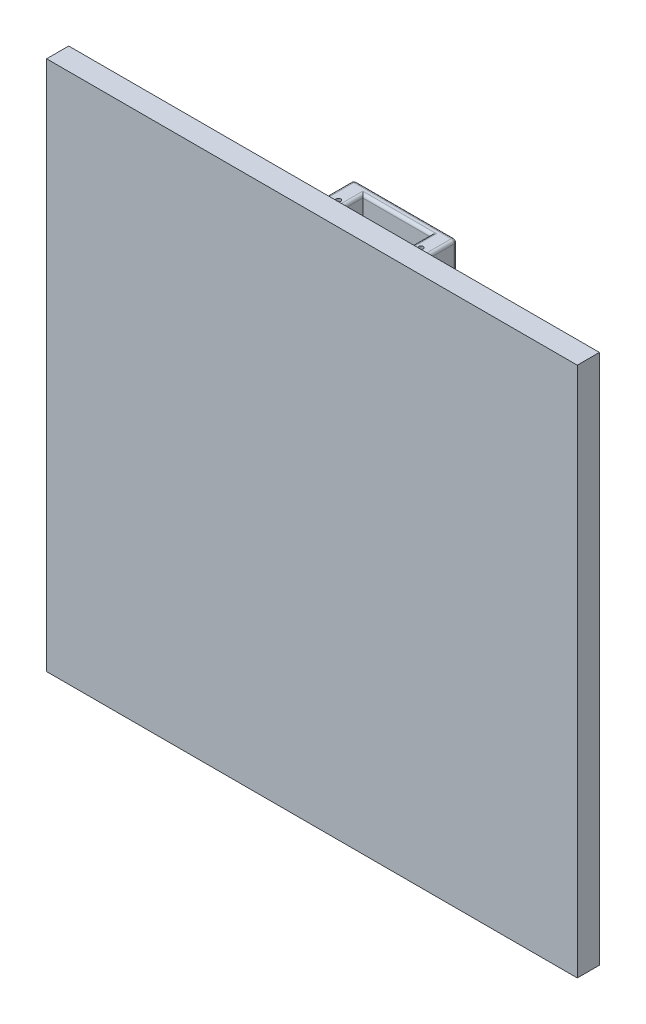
ISO-10303-21;
HEADER;
FILE_DESCRIPTION(('STEP AP214'),'2;1');
FILE_NAME('part.step','',(''),(''),'','','');
FILE_SCHEMA(('AUTOMOTIVE_DESIGN { 1 0 10303 214 1 1 1 1 }'));
ENDSEC;
DATA;
#1=APPLICATION_CONTEXT('core data for automotive mechanical design processes');
#2=APPLICATION_PROTOCOL_DEFINITION('international standard','automotive_design',2000,#1);
#3=PRODUCT_CONTEXT('',#1,'mechanical');
#4=PRODUCT('Part','Part','',(#3));
#5=PRODUCT_RELATED_PRODUCT_CATEGORY('part','',(#4));
#6=PRODUCT_DEFINITION_FORMATION('','',#4);
#7=PRODUCT_DEFINITION_CONTEXT('part definition',#1,'design');
#8=PRODUCT_DEFINITION('design','',#6,#7);
#9=PRODUCT_DEFINITION_SHAPE('','',#8);
#10=(LENGTH_UNIT() NAMED_UNIT(*) SI_UNIT(.MILLI.,.METRE.));
#11=(NAMED_UNIT(*) PLANE_ANGLE_UNIT() SI_UNIT($,.RADIAN.));
#12=(NAMED_UNIT(*) SI_UNIT($,.STERADIAN.) SOLID_ANGLE_UNIT());
#13=UNCERTAINTY_MEASURE_WITH_UNIT(LENGTH_MEASURE(1.E-05),#10,'distance_accuracy_value','');
#14=(GEOMETRIC_REPRESENTATION_CONTEXT(3) GLOBAL_UNCERTAINTY_ASSIGNED_CONTEXT((#13)) GLOBAL_UNIT_ASSIGNED_CONTEXT((#10,
#11,#12)) REPRESENTATION_CONTEXT('',''));
#15=CARTESIAN_POINT('',(0.,0.,0.));
#16=DIRECTION('',(0.,0.,1.));
#17=DIRECTION('',(1.,0.,0.));
#18=AXIS2_PLACEMENT_3D('',#15,#16,#17);
#19=CARTESIAN_POINT('',(0.,0.,0.));
#20=DIRECTION('',(0.,0.,-1.));
#21=DIRECTION('',(-1.,0.,0.));
#22=AXIS2_PLACEMENT_3D('',#19,#20,#21);
#23=PLANE('',#22);
#24=CARTESIAN_POINT('',(16.,63.5,0.));
#25=DIRECTION('',(0.,0.,-1.));
#26=DIRECTION('',(-1.,0.,0.));
#27=AXIS2_PLACEMENT_3D('',#24,#25,#26);
#28=CIRCLE('',#27,2.);
#29=CARTESIAN_POINT('',(16.,61.5,0.));
#30=VERTEX_POINT('',#29);
#31=CARTESIAN_POINT('',(14.,63.5,0.));
#32=VERTEX_POINT('',#31);
#33=EDGE_CURVE('E594',#30,#32,#28,.T.);
#34=ORIENTED_EDGE('',*,*,#33,.F.);
#35=DIRECTION('',(-1.,0.,0.));
#36=VECTOR('',#35,1.);
#37=CARTESIAN_POINT('',(0.,61.5,0.));
#38=LINE('',#37,#36);
#39=CARTESIAN_POINT('',(24.,61.5,0.));
#40=VERTEX_POINT('',#39);
#41=EDGE_CURVE('E612',#30,#40,#38,.F.);
#42=ORIENTED_EDGE('',*,*,#41,.T.);
#43=CARTESIAN_POINT('',(24.,63.5,0.));
#44=DIRECTION('',(0.,0.,-1.));
#45=DIRECTION('',(-1.,0.,0.));
#46=AXIS2_PLACEMENT_3D('',#43,#44,#45);
#47=CIRCLE('',#46,2.);
#48=CARTESIAN_POINT('',(26.,63.5,0.));
#49=VERTEX_POINT('',#48);
#50=EDGE_CURVE('E609',#49,#40,#47,.T.);
#51=ORIENTED_EDGE('',*,*,#50,.F.);
#52=DIRECTION('',(0.,-1.,0.));
#53=VECTOR('',#52,1.);
#54=CARTESIAN_POINT('',(26.,0.,0.));
#55=LINE('',#54,#53);
#56=CARTESIAN_POINT('',(26.,116.5,0.));
#57=VERTEX_POINT('',#56);
#58=EDGE_CURVE('E607',#49,#57,#55,.F.);
#59=ORIENTED_EDGE('',*,*,#58,.T.);
#60=CARTESIAN_POINT('',(24.,116.5,0.));
#61=DIRECTION('',(0.,0.,-1.));
#62=DIRECTION('',(-1.,0.,0.));
#63=AXIS2_PLACEMENT_3D('',#60,#61,#62);
#64=CIRCLE('',#63,2.);
#65=CARTESIAN_POINT('',(24.,118.5,0.));
#66=VERTEX_POINT('',#65);
#67=EDGE_CURVE('E604',#66,#57,#64,.T.);
#68=ORIENTED_EDGE('',*,*,#67,.F.);
#69=DIRECTION('',(1.,0.,0.));
#70=VECTOR('',#69,1.);
#71=CARTESIAN_POINT('',(0.,118.5,0.));
#72=LINE('',#71,#70);
#73=CARTESIAN_POINT('',(16.,118.5,0.));
#74=VERTEX_POINT('',#73);
#75=EDGE_CURVE('E602',#66,#74,#72,.F.);
#76=ORIENTED_EDGE('',*,*,#75,.T.);
#77=CARTESIAN_POINT('',(16.,116.5,0.));
#78=DIRECTION('',(0.,0.,-1.));
#79=DIRECTION('',(-1.,0.,0.));
#80=AXIS2_PLACEMENT_3D('',#77,#78,#79);
#81=CIRCLE('',#80,2.);
#82=CARTESIAN_POINT('',(14.,116.5,0.));
#83=VERTEX_POINT('',#82);
#84=EDGE_CURVE('E599',#83,#74,#81,.T.);
#85=ORIENTED_EDGE('',*,*,#84,.F.);
#86=DIRECTION('',(0.,1.,0.));
#87=VECTOR('',#86,1.);
#88=CARTESIAN_POINT('',(14.,0.,0.));
#89=LINE('',#88,#87);
#90=EDGE_CURVE('E597',#83,#32,#89,.F.);
#91=ORIENTED_EDGE('',*,*,#90,.T.);
#92=EDGE_LOOP('',(#34,#42,#51,#59,#68,#76,#85,#91));
#93=FACE_BOUND('',#92,.T.);
#94=DIRECTION('',(0.,-1.,0.));
#95=VECTOR('',#94,1.);
#96=CARTESIAN_POINT('',(0.,0.,0.));
#97=LINE('',#96,#95);
#98=CARTESIAN_POINT('',(0.,180.,0.));
#99=VERTEX_POINT('',#98);
#100=CARTESIAN_POINT('',(0.,0.,0.));
#101=VERTEX_POINT('',#100);
#102=EDGE_CURVE('E372',#99,#101,#97,.T.);
#103=ORIENTED_EDGE('',*,*,#102,.F.);
#104=DIRECTION('',(-1.,0.,0.));
#105=VECTOR('',#104,1.);
#106=CARTESIAN_POINT('',(0.,180.,0.));
#107=LINE('',#106,#105);
#108=CARTESIAN_POINT('',(180.,180.,0.));
#109=VERTEX_POINT('',#108);
#110=EDGE_CURVE('E368',#109,#99,#107,.T.);
#111=ORIENTED_EDGE('',*,*,#110,.F.);
#112=DIRECTION('',(0.,1.,0.));
#113=VECTOR('',#112,1.);
#114=CARTESIAN_POINT('',(180.,0.,0.));
#115=LINE('',#114,#113);
#116=CARTESIAN_POINT('',(180.,0.,0.));
#117=VERTEX_POINT('',#116);
#118=EDGE_CURVE('E835',#117,#109,#115,.T.);
#119=ORIENTED_EDGE('',*,*,#118,.F.);
#120=DIRECTION('',(1.,0.,0.));
#121=VECTOR('',#120,1.);
#122=CARTESIAN_POINT('',(0.,0.,0.));
#123=LINE('',#122,#121);
#124=EDGE_CURVE('E833',#101,#117,#123,.T.);
#125=ORIENTED_EDGE('',*,*,#124,.F.);
#126=EDGE_LOOP('',(#103,#111,#119,#125));
#127=FACE_BOUND('',#126,.T.);
#128=CARTESIAN_POINT('',(90.,90.,0.));
#129=DIRECTION('',(0.,0.,-1.));
#130=DIRECTION('',(-1.,0.,0.));
#131=AXIS2_PLACEMENT_3D('',#128,#129,#130);
#132=CIRCLE('',#131,25.);
#133=CARTESIAN_POINT('',(65.,90.,0.));
#134=VERTEX_POINT('',#133);
#135=EDGE_CURVE('E373',#134,#134,#132,.T.);
#136=ORIENTED_EDGE('',*,*,#135,.F.);
#137=EDGE_LOOP('',(#136));
#138=FACE_BOUND('',#137,.T.);
#139=CARTESIAN_POINT('',(73.5,156.,0.));
#140=DIRECTION('',(0.,0.,-1.));
#141=DIRECTION('',(-1.,0.,0.));
#142=AXIS2_PLACEMENT_3D('',#139,#140,#141);
#143=CIRCLE('',#142,2.);
#144=CARTESIAN_POINT('',(73.5,154.,0.));
#145=VERTEX_POINT('',#144);
#146=CARTESIAN_POINT('',(71.5,156.,0.));
#147=VERTEX_POINT('',#146);
#148=EDGE_CURVE('E420',#145,#147,#143,.T.);
#149=ORIENTED_EDGE('',*,*,#148,.F.);
#150=DIRECTION('',(-1.,0.,0.));
#151=VECTOR('',#150,1.);
#152=CARTESIAN_POINT('',(0.,154.,0.));
#153=LINE('',#152,#151);
#154=CARTESIAN_POINT('',(106.5,154.,0.));
#155=VERTEX_POINT('',#154);
#156=EDGE_CURVE('E418',#145,#155,#153,.F.);
#157=ORIENTED_EDGE('',*,*,#156,.T.);
#158=CARTESIAN_POINT('',(106.5,156.,0.));
#159=DIRECTION('',(0.,0.,-1.));
#160=DIRECTION('',(-1.,0.,0.));
#161=AXIS2_PLACEMENT_3D('',#158,#159,#160);
#162=CIRCLE('',#161,2.);
#163=CARTESIAN_POINT('',(108.5,156.,0.));
#164=VERTEX_POINT('',#163);
#165=EDGE_CURVE('E415',#164,#155,#162,.T.);
#166=ORIENTED_EDGE('',*,*,#165,.F.);
#167=DIRECTION('',(0.,-1.,0.));
#168=VECTOR('',#167,1.);
#169=CARTESIAN_POINT('',(108.5,0.,0.));
#170=LINE('',#169,#168);
#171=CARTESIAN_POINT('',(108.5,164.,0.));
#172=VERTEX_POINT('',#171);
#173=EDGE_CURVE('E410',#164,#172,#170,.F.);
#174=ORIENTED_EDGE('',*,*,#173,.T.);
#175=CARTESIAN_POINT('',(106.5,164.,0.));
#176=DIRECTION('',(0.,0.,-1.));
#177=DIRECTION('',(-1.,0.,0.));
#178=AXIS2_PLACEMENT_3D('',#175,#176,#177);
#179=CIRCLE('',#178,2.);
#180=CARTESIAN_POINT('',(106.5,166.,0.));
#181=VERTEX_POINT('',#180);
#182=EDGE_CURVE('E407',#181,#172,#179,.T.);
#183=ORIENTED_EDGE('',*,*,#182,.F.);
#184=DIRECTION('',(1.,0.,0.));
#185=VECTOR('',#184,1.);
#186=CARTESIAN_POINT('',(0.,166.,0.));
#187=LINE('',#186,#185);
#188=CARTESIAN_POINT('',(73.5,166.,0.));
#189=VERTEX_POINT('',#188);
#190=EDGE_CURVE('E405',#181,#189,#187,.F.);
#191=ORIENTED_EDGE('',*,*,#190,.T.);
#192=CARTESIAN_POINT('',(73.5,164.,0.));
#193=DIRECTION('',(0.,0.,-1.));
#194=DIRECTION('',(-1.,0.,0.));
#195=AXIS2_PLACEMENT_3D('',#192,#193,#194);
#196=CIRCLE('',#195,2.);
#197=CARTESIAN_POINT('',(71.5,164.,0.));
#198=VERTEX_POINT('',#197);
#199=EDGE_CURVE('E402',#198,#189,#196,.T.);
#200=ORIENTED_EDGE('',*,*,#199,.F.);
#201=DIRECTION('',(0.,1.,0.));
#202=VECTOR('',#201,1.);
#203=CARTESIAN_POINT('',(71.5,0.,0.));
#204=LINE('',#203,#202);
#205=EDGE_CURVE('E412',#198,#147,#204,.F.);
#206=ORIENTED_EDGE('',*,*,#205,.T.);
#207=EDGE_LOOP('',(#149,#157,#166,#174,#183,#191,#200,#206));
#208=FACE_BOUND('',#207,.T.);
#209=ADVANCED_FACE('F43',(#93,#127,#138,#208),#23,.T.);
#210=CARTESIAN_POINT('',(72.5,155.,-24.25));
#211=DIRECTION('',(0.,1.,0.));
#212=DIRECTION('',(0.,0.,1.));
#213=AXIS2_PLACEMENT_3D('',#210,#211,#212);
#214=PLANE('',#213);
#215=DIRECTION('',(1.,0.,0.));
#216=VECTOR('',#215,1.);
#217=CARTESIAN_POINT('',(72.5,155.,-7.75));
#218=LINE('',#217,#216);
#219=CARTESIAN_POINT('',(77.5,155.,-7.75));
#220=VERTEX_POINT('',#219);
#221=CARTESIAN_POINT('',(102.5,155.,-7.75));
#222=VERTEX_POINT('',#221);
#223=EDGE_CURVE('E454',#220,#222,#218,.T.);
#224=ORIENTED_EDGE('',*,*,#223,.T.);
#225=DIRECTION('',(0.,0.,-1.));
#226=VECTOR('',#225,1.);
#227=CARTESIAN_POINT('',(102.5,155.,-24.25));
#228=LINE('',#227,#226);
#229=CARTESIAN_POINT('',(102.5,155.,-22.25));
#230=VERTEX_POINT('',#229);
#231=EDGE_CURVE('E456',#222,#230,#228,.T.);
#232=ORIENTED_EDGE('',*,*,#231,.T.);
#233=DIRECTION('',(1.,0.,0.));
#234=VECTOR('',#233,1.);
#235=CARTESIAN_POINT('',(78.5,155.,-22.25));
#236=LINE('',#235,#234);
#237=CARTESIAN_POINT('',(77.5,155.,-22.25));
#238=VERTEX_POINT('',#237);
#239=EDGE_CURVE('E450',#230,#238,#236,.F.);
#240=ORIENTED_EDGE('',*,*,#239,.T.);
#241=DIRECTION('',(0.,0.,-1.));
#242=VECTOR('',#241,1.);
#243=CARTESIAN_POINT('',(77.5,155.,-8.75));
#244=LINE('',#243,#242);
#245=EDGE_CURVE('E452',#238,#220,#244,.F.);
#246=ORIENTED_EDGE('',*,*,#245,.T.);
#247=EDGE_LOOP('',(#224,#232,#240,#246));
#248=FACE_BOUND('',#247,.T.);
#249=DIRECTION('',(-1.,0.,0.));
#250=VECTOR('',#249,1.);
#251=CARTESIAN_POINT('',(107.5,155.,-23.25));
#252=LINE('',#251,#250);
#253=CARTESIAN_POINT('',(73.5,155.,-23.25));
#254=VERTEX_POINT('',#253);
#255=CARTESIAN_POINT('',(106.5,155.,-23.25));
#256=VERTEX_POINT('',#255);
#257=EDGE_CURVE('E445',#254,#256,#252,.F.);
#258=ORIENTED_EDGE('',*,*,#257,.T.);
#259=DIRECTION('',(0.,0.,1.));
#260=VECTOR('',#259,1.);
#261=CARTESIAN_POINT('',(106.5,155.,-24.25));
#262=LINE('',#261,#260);
#263=CARTESIAN_POINT('',(106.5,155.,-1.));
#264=VERTEX_POINT('',#263);
#265=EDGE_CURVE('E447',#256,#264,#262,.T.);
#266=ORIENTED_EDGE('',*,*,#265,.T.);
#267=DIRECTION('',(-1.,0.,0.));
#268=VECTOR('',#267,1.);
#269=CARTESIAN_POINT('',(72.5,155.,-1.));
#270=LINE('',#269,#268);
#271=CARTESIAN_POINT('',(73.5,155.,-1.));
#272=VERTEX_POINT('',#271);
#273=EDGE_CURVE('E441',#264,#272,#270,.T.);
#274=ORIENTED_EDGE('',*,*,#273,.T.);
#275=DIRECTION('',(0.,0.,1.));
#276=VECTOR('',#275,1.);
#277=CARTESIAN_POINT('',(73.5,155.,-24.25));
#278=LINE('',#277,#276);
#279=EDGE_CURVE('E443',#272,#254,#278,.F.);
#280=ORIENTED_EDGE('',*,*,#279,.T.);
#281=EDGE_LOOP('',(#258,#266,#274,#280));
#282=FACE_BOUND('',#281,.T.);
#283=ADVANCED_FACE('F857',(#248,#282),#214,.F.);
#284=CARTESIAN_POINT('',(72.5,165.,-24.25));
#285=DIRECTION('',(0.,-1.,0.));
#286=DIRECTION('',(0.,0.,-1.));
#287=AXIS2_PLACEMENT_3D('',#284,#285,#286);
#288=PLANE('',#287);
#289=CARTESIAN_POINT('',(76.,165.,-15.5));
#290=DIRECTION('',(0.,1.,0.));
#291=DIRECTION('',(0.,0.,1.));
#292=AXIS2_PLACEMENT_3D('',#289,#290,#291);
#293=CIRCLE('',#292,0.749999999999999);
#294=CARTESIAN_POINT('',(76.,165.,-14.75));
#295=VERTEX_POINT('',#294);
#296=EDGE_CURVE('E810',#295,#295,#293,.T.);
#297=ORIENTED_EDGE('',*,*,#296,.F.);
#298=EDGE_LOOP('',(#297));
#299=FACE_BOUND('',#298,.T.);
#300=CARTESIAN_POINT('',(104.,165.,-15.5));
#301=DIRECTION('',(0.,1.,0.));
#302=DIRECTION('',(0.,0.,-1.));
#303=AXIS2_PLACEMENT_3D('',#300,#301,#302);
#304=CIRCLE('',#303,0.749999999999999);
#305=CARTESIAN_POINT('',(104.,165.,-14.75));
#306=VERTEX_POINT('',#305);
#307=EDGE_CURVE('E802',#306,#306,#304,.T.);
#308=ORIENTED_EDGE('',*,*,#307,.F.);
#309=EDGE_LOOP('',(#308));
#310=FACE_BOUND('',#309,.T.);
#311=DIRECTION('',(1.,0.,0.));
#312=VECTOR('',#311,1.);
#313=CARTESIAN_POINT('',(72.5,165.,-7.75));
#314=LINE('',#313,#312);
#315=CARTESIAN_POINT('',(102.5,165.,-7.75));
#316=VERTEX_POINT('',#315);
#317=CARTESIAN_POINT('',(77.5,165.,-7.75));
#318=VERTEX_POINT('',#317);
#319=EDGE_CURVE('E490',#316,#318,#314,.F.);
#320=ORIENTED_EDGE('',*,*,#319,.T.);
#321=DIRECTION('',(0.,0.,-1.));
#322=VECTOR('',#321,1.);
#323=CARTESIAN_POINT('',(77.5,165.,-21.25));
#324=LINE('',#323,#322);
#325=CARTESIAN_POINT('',(77.5,165.,-22.25));
#326=VERTEX_POINT('',#325);
#327=EDGE_CURVE('E492',#318,#326,#324,.T.);
#328=ORIENTED_EDGE('',*,*,#327,.T.);
#329=DIRECTION('',(1.,0.,0.));
#330=VECTOR('',#329,1.);
#331=CARTESIAN_POINT('',(101.5,165.,-22.25));
#332=LINE('',#331,#330);
#333=CARTESIAN_POINT('',(102.5,165.,-22.25));
#334=VERTEX_POINT('',#333);
#335=EDGE_CURVE('E486',#326,#334,#332,.T.);
#336=ORIENTED_EDGE('',*,*,#335,.T.);
#337=DIRECTION('',(0.,0.,-1.));
#338=VECTOR('',#337,1.);
#339=CARTESIAN_POINT('',(102.5,165.,-24.25));
#340=LINE('',#339,#338);
#341=EDGE_CURVE('E488',#334,#316,#340,.F.);
#342=ORIENTED_EDGE('',*,*,#341,.T.);
#343=EDGE_LOOP('',(#320,#328,#336,#342));
#344=FACE_BOUND('',#343,.T.);
#345=DIRECTION('',(1.,0.,0.));
#346=VECTOR('',#345,1.);
#347=CARTESIAN_POINT('',(72.5,165.,-23.25));
#348=LINE('',#347,#346);
#349=CARTESIAN_POINT('',(106.5,165.,-23.25));
#350=VERTEX_POINT('',#349);
#351=CARTESIAN_POINT('',(73.5,165.,-23.25));
#352=VERTEX_POINT('',#351);
#353=EDGE_CURVE('E481',#350,#352,#348,.F.);
#354=ORIENTED_EDGE('',*,*,#353,.T.);
#355=DIRECTION('',(0.,0.,1.));
#356=VECTOR('',#355,1.);
#357=CARTESIAN_POINT('',(73.5,165.,-24.25));
#358=LINE('',#357,#356);
#359=CARTESIAN_POINT('',(73.5,165.,-1.));
#360=VERTEX_POINT('',#359);
#361=EDGE_CURVE('E483',#352,#360,#358,.T.);
#362=ORIENTED_EDGE('',*,*,#361,.T.);
#363=DIRECTION('',(1.,0.,0.));
#364=VECTOR('',#363,1.);
#365=CARTESIAN_POINT('',(72.5,165.,-1.));
#366=LINE('',#365,#364);
#367=CARTESIAN_POINT('',(106.5,165.,-1.));
#368=VERTEX_POINT('',#367);
#369=EDGE_CURVE('E477',#360,#368,#366,.T.);
#370=ORIENTED_EDGE('',*,*,#369,.T.);
#371=DIRECTION('',(0.,0.,1.));
#372=VECTOR('',#371,1.);
#373=CARTESIAN_POINT('',(106.5,165.,-24.25));
#374=LINE('',#373,#372);
#375=EDGE_CURVE('E479',#368,#350,#374,.F.);
#376=ORIENTED_EDGE('',*,*,#375,.T.);
#377=EDGE_LOOP('',(#354,#362,#370,#376));
#378=FACE_BOUND('',#377,.T.);
#379=ADVANCED_FACE('F863',(#299,#310,#344,#378),#288,.F.);
#380=CARTESIAN_POINT('',(0.,0.,7.5));
#381=DIRECTION('',(1.,0.,0.));
#382=DIRECTION('',(0.,0.,-1.));
#383=AXIS2_PLACEMENT_3D('',#380,#381,#382);
#384=PLANE('',#383);
#385=ORIENTED_EDGE('',*,*,#102,.T.);
#386=DIRECTION('',(0.,0.,-1.));
#387=VECTOR('',#386,1.);
#388=CARTESIAN_POINT('',(0.,0.,7.5));
#389=LINE('',#388,#387);
#390=CARTESIAN_POINT('',(0.,0.,7.5));
#391=VERTEX_POINT('',#390);
#392=EDGE_CURVE('E352',#391,#101,#389,.T.);
#393=ORIENTED_EDGE('',*,*,#392,.F.);
#394=DIRECTION('',(0.,-1.,0.));
#395=VECTOR('',#394,1.);
#396=CARTESIAN_POINT('',(0.,0.,7.5));
#397=LINE('',#396,#395);
#398=CARTESIAN_POINT('',(0.,180.,7.5));
#399=VERTEX_POINT('',#398);
#400=EDGE_CURVE('E359',#399,#391,#397,.T.);
#401=ORIENTED_EDGE('',*,*,#400,.F.);
#402=DIRECTION('',(0.,0.,-1.));
#403=VECTOR('',#402,1.);
#404=CARTESIAN_POINT('',(0.,180.,7.5));
#405=LINE('',#404,#403);
#406=EDGE_CURVE('E831',#399,#99,#405,.T.);
#407=ORIENTED_EDGE('',*,*,#406,.T.);
#408=EDGE_LOOP('',(#385,#393,#401,#407));
#409=FACE_BOUND('',#408,.T.);
#410=ADVANCED_FACE('F370',(#409),#384,.F.);
#411=CARTESIAN_POINT('',(0.,0.,7.5));
#412=DIRECTION('',(0.,1.,0.));
#413=DIRECTION('',(0.,0.,1.));
#414=AXIS2_PLACEMENT_3D('',#411,#412,#413);
#415=PLANE('',#414);
#416=ORIENTED_EDGE('',*,*,#124,.T.);
#417=DIRECTION('',(0.,0.,-1.));
#418=VECTOR('',#417,1.);
#419=CARTESIAN_POINT('',(180.,0.,7.5));
#420=LINE('',#419,#418);
#421=CARTESIAN_POINT('',(180.,0.,7.5));
#422=VERTEX_POINT('',#421);
#423=EDGE_CURVE('E355',#422,#117,#420,.T.);
#424=ORIENTED_EDGE('',*,*,#423,.F.);
#425=DIRECTION('',(1.,0.,0.));
#426=VECTOR('',#425,1.);
#427=CARTESIAN_POINT('',(0.,0.,7.5));
#428=LINE('',#427,#426);
#429=EDGE_CURVE('E348',#391,#422,#428,.T.);
#430=ORIENTED_EDGE('',*,*,#429,.F.);
#431=ORIENTED_EDGE('',*,*,#392,.T.);
#432=EDGE_LOOP('',(#416,#424,#430,#431));
#433=FACE_BOUND('',#432,.T.);
#434=ADVANCED_FACE('F350',(#433),#415,.F.);
#435=CARTESIAN_POINT('',(180.,0.,7.5));
#436=DIRECTION('',(-1.,0.,0.));
#437=DIRECTION('',(0.,0.,1.));
#438=AXIS2_PLACEMENT_3D('',#435,#436,#437);
#439=PLANE('',#438);
#440=ORIENTED_EDGE('',*,*,#118,.T.);
#441=DIRECTION('',(0.,0.,-1.));
#442=VECTOR('',#441,1.);
#443=CARTESIAN_POINT('',(180.,180.,7.5));
#444=LINE('',#443,#442);
#445=CARTESIAN_POINT('',(180.,180.,7.5));
#446=VERTEX_POINT('',#445);
#447=EDGE_CURVE('E378',#446,#109,#444,.T.);
#448=ORIENTED_EDGE('',*,*,#447,.F.);
#449=DIRECTION('',(0.,1.,0.));
#450=VECTOR('',#449,1.);
#451=CARTESIAN_POINT('',(180.,0.,7.5));
#452=LINE('',#451,#450);
#453=EDGE_CURVE('E358',#422,#446,#452,.T.);
#454=ORIENTED_EDGE('',*,*,#453,.F.);
#455=ORIENTED_EDGE('',*,*,#423,.T.);
#456=EDGE_LOOP('',(#440,#448,#454,#455));
#457=FACE_BOUND('',#456,.T.);
#458=ADVANCED_FACE('F847',(#457),#439,.F.);
#459=CARTESIAN_POINT('',(0.,180.,7.5));
#460=DIRECTION('',(0.,-1.,0.));
#461=DIRECTION('',(0.,0.,-1.));
#462=AXIS2_PLACEMENT_3D('',#459,#460,#461);
#463=PLANE('',#462);
#464=ORIENTED_EDGE('',*,*,#110,.T.);
#465=ORIENTED_EDGE('',*,*,#406,.F.);
#466=DIRECTION('',(-1.,0.,0.));
#467=VECTOR('',#466,1.);
#468=CARTESIAN_POINT('',(0.,180.,7.5));
#469=LINE('',#468,#467);
#470=EDGE_CURVE('E364',#446,#399,#469,.T.);
#471=ORIENTED_EDGE('',*,*,#470,.F.);
#472=ORIENTED_EDGE('',*,*,#447,.T.);
#473=EDGE_LOOP('',(#464,#465,#471,#472));
#474=FACE_BOUND('',#473,.T.);
#475=ADVANCED_FACE('F842',(#474),#463,.F.);
#476=CARTESIAN_POINT('',(0.,0.,7.5));
#477=DIRECTION('',(0.,0.,-1.));
#478=DIRECTION('',(-1.,0.,0.));
#479=AXIS2_PLACEMENT_3D('',#476,#477,#478);
#480=PLANE('',#479);
#481=ORIENTED_EDGE('',*,*,#400,.T.);
#482=ORIENTED_EDGE('',*,*,#429,.T.);
#483=ORIENTED_EDGE('',*,*,#453,.T.);
#484=ORIENTED_EDGE('',*,*,#470,.T.);
#485=EDGE_LOOP('',(#481,#482,#483,#484));
#486=FACE_BOUND('',#485,.T.);
#487=ADVANCED_FACE('F362',(#486),#480,.F.);
#488=CARTESIAN_POINT('',(90.,90.,-50.));
#489=DIRECTION('',(0.,0.,1.));
#490=DIRECTION('',(1.,0.,0.));
#491=AXIS2_PLACEMENT_3D('',#488,#489,#490);
#492=CYLINDRICAL_SURFACE('',#491,25.);
#493=CARTESIAN_POINT('',(90.,90.,-47.5));
#494=DIRECTION('',(0.,0.,-1.));
#495=DIRECTION('',(-1.,0.,0.));
#496=AXIS2_PLACEMENT_3D('',#493,#494,#495);
#497=CIRCLE('',#496,25.);
#498=CARTESIAN_POINT('',(65.,90.,-47.5));
#499=VERTEX_POINT('',#498);
#500=EDGE_CURVE('E384',#499,#499,#497,.F.);
#501=ORIENTED_EDGE('',*,*,#500,.T.);
#502=EDGE_LOOP('',(#501));
#503=FACE_BOUND('',#502,.T.);
#504=ORIENTED_EDGE('',*,*,#135,.T.);
#505=EDGE_LOOP('',(#504));
#506=FACE_BOUND('',#505,.T.);
#507=ADVANCED_FACE('F869',(#503,#506),#492,.T.);
#508=CARTESIAN_POINT('',(90.,90.,-50.));
#509=DIRECTION('',(0.,0.,-1.));
#510=DIRECTION('',(-1.,0.,0.));
#511=AXIS2_PLACEMENT_3D('',#508,#509,#510);
#512=PLANE('',#511);
#513=CARTESIAN_POINT('',(90.,90.,-50.));
#514=DIRECTION('',(0.,0.,-1.));
#515=DIRECTION('',(-1.,0.,0.));
#516=AXIS2_PLACEMENT_3D('',#513,#514,#515);
#517=CIRCLE('',#516,22.3606797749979);
#518=CARTESIAN_POINT('',(67.6393202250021,90.,-50.));
#519=VERTEX_POINT('',#518);
#520=EDGE_CURVE('E387',#519,#519,#517,.F.);
#521=ORIENTED_EDGE('',*,*,#520,.T.);
#522=EDGE_LOOP('',(#521));
#523=FACE_BOUND('',#522,.T.);
#524=CARTESIAN_POINT('',(90.,90.,-50.));
#525=DIRECTION('',(0.,0.,-1.));
#526=DIRECTION('',(-1.,0.,0.));
#527=AXIS2_PLACEMENT_3D('',#524,#525,#526);
#528=CIRCLE('',#527,22.5);
#529=CARTESIAN_POINT('',(67.5,90.,-50.));
#530=VERTEX_POINT('',#529);
#531=EDGE_CURVE('E376',#530,#530,#528,.T.);
#532=ORIENTED_EDGE('',*,*,#531,.T.);
#533=EDGE_LOOP('',(#532));
#534=FACE_BOUND('',#533,.T.);
#535=ADVANCED_FACE('F872',(#523,#534),#512,.T.);
#536=CARTESIAN_POINT('',(90.,90.,-50.));
#537=DIRECTION('',(1.,0.,0.));
#538=DIRECTION('',(0.,-1.,0.));
#539=AXIS2_PLACEMENT_3D('',#536,#537,#538);
#540=SPHERICAL_SURFACE('',#539,20.);
#541=CARTESIAN_POINT('',(90.,90.,-50.));
#542=DIRECTION('',(0.,0.,-1.));
#543=DIRECTION('',(-1.,0.,0.));
#544=AXIS2_PLACEMENT_3D('',#541,#542,#543);
#545=SPHERICAL_SURFACE('',#544,20.);
#546=CARTESIAN_POINT('',(90.,90.,-47.7777777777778));
#547=DIRECTION('',(0.,0.,-1.));
#548=DIRECTION('',(-1.,0.,0.));
#549=AXIS2_PLACEMENT_3D('',#546,#547,#548);
#550=CIRCLE('',#549,19.8761597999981);
#551=CARTESIAN_POINT('',(70.1238402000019,90.,-47.7777777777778));
#552=VERTEX_POINT('',#551);
#553=EDGE_CURVE('E390',#552,#552,#550,.T.);
#554=ORIENTED_EDGE('',*,*,#553,.T.);
#555=EDGE_LOOP('',(#554));
#556=FACE_BOUND('',#555,.T.);
#557=ADVANCED_FACE('F876',(#556),#545,.F.);
#558=CARTESIAN_POINT('',(90.,90.,-47.5));
#559=DIRECTION('',(0.,0.,-1.));
#560=DIRECTION('',(-1.,0.,0.));
#561=AXIS2_PLACEMENT_3D('',#558,#559,#560);
#562=TOROIDAL_SURFACE('',#561,22.5,2.5);
#563=ORIENTED_EDGE('',*,*,#500,.F.);
#564=EDGE_LOOP('',(#563));
#565=FACE_BOUND('',#564,.T.);
#566=ORIENTED_EDGE('',*,*,#531,.F.);
#567=EDGE_LOOP('',(#566));
#568=FACE_BOUND('',#567,.T.);
#569=ADVANCED_FACE('F880',(#565,#568),#562,.T.);
#570=CARTESIAN_POINT('',(90.,90.,-47.5));
#571=DIRECTION('',(0.,0.,-1.));
#572=DIRECTION('',(-1.,0.,0.));
#573=AXIS2_PLACEMENT_3D('',#570,#571,#572);
#574=TOROIDAL_SURFACE('',#573,22.3606797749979,2.5);
#575=ORIENTED_EDGE('',*,*,#553,.F.);
#576=EDGE_LOOP('',(#575));
#577=FACE_BOUND('',#576,.T.);
#578=ORIENTED_EDGE('',*,*,#520,.F.);
#579=EDGE_LOOP('',(#578));
#580=FACE_BOUND('',#579,.T.);
#581=ADVANCED_FACE('F885',(#577,#580),#574,.T.);
#582=CARTESIAN_POINT('',(107.5,155.,-24.25));
#583=DIRECTION('',(-1.,0.,0.));
#584=DIRECTION('',(0.,0.,1.));
#585=AXIS2_PLACEMENT_3D('',#582,#583,#584);
#586=PLANE('',#585);
#587=DIRECTION('',(0.,-1.,0.));
#588=VECTOR('',#587,1.);
#589=CARTESIAN_POINT('',(107.5,155.,-1.));
#590=LINE('',#589,#588);
#591=CARTESIAN_POINT('',(107.5,164.,-1.));
#592=VERTEX_POINT('',#591);
#593=CARTESIAN_POINT('',(107.5,156.,-1.));
#594=VERTEX_POINT('',#593);
#595=EDGE_CURVE('E434',#592,#594,#590,.T.);
#596=ORIENTED_EDGE('',*,*,#595,.T.);
#597=DIRECTION('',(0.,0.,1.));
#598=VECTOR('',#597,1.);
#599=CARTESIAN_POINT('',(107.5,156.,-24.25));
#600=LINE('',#599,#598);
#601=CARTESIAN_POINT('',(107.5,156.,-23.25));
#602=VERTEX_POINT('',#601);
#603=EDGE_CURVE('E439',#594,#602,#600,.F.);
#604=ORIENTED_EDGE('',*,*,#603,.T.);
#605=DIRECTION('',(0.,-1.,0.));
#606=VECTOR('',#605,1.);
#607=CARTESIAN_POINT('',(107.5,165.,-23.25));
#608=LINE('',#607,#606);
#609=CARTESIAN_POINT('',(107.5,164.,-23.25));
#610=VERTEX_POINT('',#609);
#611=EDGE_CURVE('E436',#602,#610,#608,.F.);
#612=ORIENTED_EDGE('',*,*,#611,.T.);
#613=DIRECTION('',(0.,0.,1.));
#614=VECTOR('',#613,1.);
#615=CARTESIAN_POINT('',(107.5,164.,-24.25));
#616=LINE('',#615,#614);
#617=EDGE_CURVE('E432',#610,#592,#616,.T.);
#618=ORIENTED_EDGE('',*,*,#617,.T.);
#619=EDGE_LOOP('',(#596,#604,#612,#618));
#620=FACE_BOUND('',#619,.T.);
#621=ADVANCED_FACE('F882',(#620),#586,.F.);
#622=CARTESIAN_POINT('',(72.5,155.,-24.25));
#623=DIRECTION('',(1.,0.,0.));
#624=DIRECTION('',(0.,0.,-1.));
#625=AXIS2_PLACEMENT_3D('',#622,#623,#624);
#626=PLANE('',#625);
#627=DIRECTION('',(0.,1.,0.));
#628=VECTOR('',#627,1.);
#629=CARTESIAN_POINT('',(72.5,155.,-23.25));
#630=LINE('',#629,#628);
#631=CARTESIAN_POINT('',(72.5,164.,-23.25));
#632=VERTEX_POINT('',#631);
#633=CARTESIAN_POINT('',(72.5,156.,-23.25));
#634=VERTEX_POINT('',#633);
#635=EDGE_CURVE('E395',#632,#634,#630,.F.);
#636=ORIENTED_EDGE('',*,*,#635,.T.);
#637=DIRECTION('',(0.,0.,1.));
#638=VECTOR('',#637,1.);
#639=CARTESIAN_POINT('',(72.5,156.,-24.25));
#640=LINE('',#639,#638);
#641=CARTESIAN_POINT('',(72.5,156.,-1.));
#642=VERTEX_POINT('',#641);
#643=EDGE_CURVE('E400',#634,#642,#640,.T.);
#644=ORIENTED_EDGE('',*,*,#643,.T.);
#645=DIRECTION('',(0.,1.,0.));
#646=VECTOR('',#645,1.);
#647=CARTESIAN_POINT('',(72.5,155.,-1.));
#648=LINE('',#647,#646);
#649=CARTESIAN_POINT('',(72.5,164.,-1.));
#650=VERTEX_POINT('',#649);
#651=EDGE_CURVE('E397',#642,#650,#648,.T.);
#652=ORIENTED_EDGE('',*,*,#651,.T.);
#653=DIRECTION('',(0.,0.,1.));
#654=VECTOR('',#653,1.);
#655=CARTESIAN_POINT('',(72.5,164.,-24.25));
#656=LINE('',#655,#654);
#657=EDGE_CURVE('E393',#650,#632,#656,.F.);
#658=ORIENTED_EDGE('',*,*,#657,.T.);
#659=EDGE_LOOP('',(#636,#644,#652,#658));
#660=FACE_BOUND('',#659,.T.);
#661=ADVANCED_FACE('F884',(#660),#626,.F.);
#662=CARTESIAN_POINT('',(0.,0.,-24.25));
#663=DIRECTION('',(0.,0.,-1.));
#664=DIRECTION('',(-1.,0.,0.));
#665=AXIS2_PLACEMENT_3D('',#662,#663,#664);
#666=PLANE('',#665);
#667=DIRECTION('',(0.,-1.,0.));
#668=VECTOR('',#667,1.);
#669=CARTESIAN_POINT('',(106.5,155.,-24.25));
#670=LINE('',#669,#668);
#671=CARTESIAN_POINT('',(106.5,164.,-24.25));
#672=VERTEX_POINT('',#671);
#673=CARTESIAN_POINT('',(106.5,156.,-24.25));
#674=VERTEX_POINT('',#673);
#675=EDGE_CURVE('E425',#672,#674,#670,.T.);
#676=ORIENTED_EDGE('',*,*,#675,.T.);
#677=DIRECTION('',(-1.,0.,0.));
#678=VECTOR('',#677,1.);
#679=CARTESIAN_POINT('',(72.5,156.,-24.25));
#680=LINE('',#679,#678);
#681=CARTESIAN_POINT('',(73.5,156.,-24.25));
#682=VERTEX_POINT('',#681);
#683=EDGE_CURVE('E430',#674,#682,#680,.T.);
#684=ORIENTED_EDGE('',*,*,#683,.T.);
#685=DIRECTION('',(0.,1.,0.));
#686=VECTOR('',#685,1.);
#687=CARTESIAN_POINT('',(73.5,165.,-24.25));
#688=LINE('',#687,#686);
#689=CARTESIAN_POINT('',(73.5,164.,-24.25));
#690=VERTEX_POINT('',#689);
#691=EDGE_CURVE('E427',#682,#690,#688,.T.);
#692=ORIENTED_EDGE('',*,*,#691,.T.);
#693=DIRECTION('',(1.,0.,0.));
#694=VECTOR('',#693,1.);
#695=CARTESIAN_POINT('',(107.5,164.,-24.25));
#696=LINE('',#695,#694);
#697=EDGE_CURVE('E423',#690,#672,#696,.T.);
#698=ORIENTED_EDGE('',*,*,#697,.T.);
#699=EDGE_LOOP('',(#676,#684,#692,#698));
#700=FACE_BOUND('',#699,.T.);
#701=ADVANCED_FACE('F890',(#700),#666,.T.);
#702=CARTESIAN_POINT('',(78.5,152.5,-21.25));
#703=DIRECTION('',(0.,0.,1.));
#704=DIRECTION('',(1.,0.,0.));
#705=AXIS2_PLACEMENT_3D('',#702,#703,#704);
#706=PLANE('',#705);
#707=DIRECTION('',(0.,1.,0.));
#708=VECTOR('',#707,1.);
#709=CARTESIAN_POINT('',(78.5,152.5,-21.25));
#710=LINE('',#709,#708);
#711=CARTESIAN_POINT('',(78.5,156.,-21.25));
#712=VERTEX_POINT('',#711);
#713=CARTESIAN_POINT('',(78.5,164.,-21.25));
#714=VERTEX_POINT('',#713);
#715=EDGE_CURVE('E565',#712,#714,#710,.T.);
#716=ORIENTED_EDGE('',*,*,#715,.F.);
#717=DIRECTION('',(1.,0.,0.));
#718=VECTOR('',#717,1.);
#719=CARTESIAN_POINT('',(101.5,156.,-21.25));
#720=LINE('',#719,#718);
#721=CARTESIAN_POINT('',(101.5,156.,-21.25));
#722=VERTEX_POINT('',#721);
#723=EDGE_CURVE('E475',#712,#722,#720,.T.);
#724=ORIENTED_EDGE('',*,*,#723,.T.);
#725=DIRECTION('',(0.,1.,0.));
#726=VECTOR('',#725,1.);
#727=CARTESIAN_POINT('',(101.5,152.5,-21.25));
#728=LINE('',#727,#726);
#729=CARTESIAN_POINT('',(101.5,164.,-21.25));
#730=VERTEX_POINT('',#729);
#731=EDGE_CURVE('E826',#722,#730,#728,.T.);
#732=ORIENTED_EDGE('',*,*,#731,.T.);
#733=DIRECTION('',(1.,0.,0.));
#734=VECTOR('',#733,1.);
#735=CARTESIAN_POINT('',(78.5,164.,-21.25));
#736=LINE('',#735,#734);
#737=EDGE_CURVE('E473',#730,#714,#736,.F.);
#738=ORIENTED_EDGE('',*,*,#737,.T.);
#739=EDGE_LOOP('',(#716,#724,#732,#738));
#740=FACE_BOUND('',#739,.T.);
#741=ADVANCED_FACE('F897',(#740),#706,.T.);
#742=CARTESIAN_POINT('',(101.5,152.5,-8.75));
#743=DIRECTION('',(1.,0.,0.));
#744=DIRECTION('',(0.,0.,-1.));
#745=AXIS2_PLACEMENT_3D('',#742,#743,#744);
#746=PLANE('',#745);
#747=ORIENTED_EDGE('',*,*,#731,.F.);
#748=DIRECTION('',(0.,0.,-1.));
#749=VECTOR('',#748,1.);
#750=CARTESIAN_POINT('',(101.5,156.,-8.75));
#751=LINE('',#750,#749);
#752=CARTESIAN_POINT('',(101.5,156.,-8.75));
#753=VERTEX_POINT('',#752);
#754=EDGE_CURVE('E461',#722,#753,#751,.F.);
#755=ORIENTED_EDGE('',*,*,#754,.T.);
#756=DIRECTION('',(0.,1.,0.));
#757=VECTOR('',#756,1.);
#758=CARTESIAN_POINT('',(101.5,152.5,-8.75));
#759=LINE('',#758,#757);
#760=CARTESIAN_POINT('',(101.5,164.,-8.75));
#761=VERTEX_POINT('',#760);
#762=EDGE_CURVE('E823',#753,#761,#759,.T.);
#763=ORIENTED_EDGE('',*,*,#762,.T.);
#764=DIRECTION('',(0.,0.,-1.));
#765=VECTOR('',#764,1.);
#766=CARTESIAN_POINT('',(101.5,164.,-8.75));
#767=LINE('',#766,#765);
#768=EDGE_CURVE('E459',#761,#730,#767,.T.);
#769=ORIENTED_EDGE('',*,*,#768,.T.);
#770=EDGE_LOOP('',(#747,#755,#763,#769));
#771=FACE_BOUND('',#770,.T.);
#772=ADVANCED_FACE('F901',(#771),#746,.F.);
#773=CARTESIAN_POINT('',(78.5,152.5,-8.75));
#774=DIRECTION('',(0.,0.,1.));
#775=DIRECTION('',(1.,0.,0.));
#776=AXIS2_PLACEMENT_3D('',#773,#774,#775);
#777=PLANE('',#776);
#778=ORIENTED_EDGE('',*,*,#762,.F.);
#779=DIRECTION('',(1.,0.,0.));
#780=VECTOR('',#779,1.);
#781=CARTESIAN_POINT('',(78.5,156.,-8.75));
#782=LINE('',#781,#780);
#783=CARTESIAN_POINT('',(78.5,156.,-8.75));
#784=VERTEX_POINT('',#783);
#785=EDGE_CURVE('E466',#753,#784,#782,.F.);
#786=ORIENTED_EDGE('',*,*,#785,.T.);
#787=DIRECTION('',(0.,1.,0.));
#788=VECTOR('',#787,1.);
#789=CARTESIAN_POINT('',(78.5,152.5,-8.75));
#790=LINE('',#789,#788);
#791=CARTESIAN_POINT('',(78.5,164.,-8.75));
#792=VERTEX_POINT('',#791);
#793=EDGE_CURVE('E820',#784,#792,#790,.T.);
#794=ORIENTED_EDGE('',*,*,#793,.T.);
#795=DIRECTION('',(1.,0.,0.));
#796=VECTOR('',#795,1.);
#797=CARTESIAN_POINT('',(78.5,164.,-8.75));
#798=LINE('',#797,#796);
#799=EDGE_CURVE('E464',#792,#761,#798,.T.);
#800=ORIENTED_EDGE('',*,*,#799,.T.);
#801=EDGE_LOOP('',(#778,#786,#794,#800));
#802=FACE_BOUND('',#801,.T.);
#803=ADVANCED_FACE('F905',(#802),#777,.F.);
#804=CARTESIAN_POINT('',(78.5,152.5,-8.75));
#805=DIRECTION('',(1.,0.,0.));
#806=DIRECTION('',(0.,0.,-1.));
#807=AXIS2_PLACEMENT_3D('',#804,#805,#806);
#808=PLANE('',#807);
#809=ORIENTED_EDGE('',*,*,#793,.F.);
#810=DIRECTION('',(0.,0.,-1.));
#811=VECTOR('',#810,1.);
#812=CARTESIAN_POINT('',(78.5,156.,-21.25));
#813=LINE('',#812,#811);
#814=EDGE_CURVE('E471',#784,#712,#813,.T.);
#815=ORIENTED_EDGE('',*,*,#814,.T.);
#816=ORIENTED_EDGE('',*,*,#715,.T.);
#817=DIRECTION('',(0.,0.,-1.));
#818=VECTOR('',#817,1.);
#819=CARTESIAN_POINT('',(78.5,164.,-8.75));
#820=LINE('',#819,#818);
#821=EDGE_CURVE('E468',#714,#792,#820,.F.);
#822=ORIENTED_EDGE('',*,*,#821,.T.);
#823=EDGE_LOOP('',(#809,#815,#816,#822));
#824=FACE_BOUND('',#823,.T.);
#825=ADVANCED_FACE('F909',(#824),#808,.T.);
#826=CARTESIAN_POINT('',(106.5,0.,-23.25));
#827=DIRECTION('',(0.,1.,0.));
#828=DIRECTION('',(0.,0.,1.));
#829=AXIS2_PLACEMENT_3D('',#826,#827,#828);
#830=CYLINDRICAL_SURFACE('',#829,1.);
#831=CARTESIAN_POINT('',(106.5,156.,-23.25));
#832=DIRECTION('',(0.,-1.,0.));
#833=DIRECTION('',(0.,0.,-1.));
#834=AXIS2_PLACEMENT_3D('',#831,#832,#833);
#835=CIRCLE('',#834,1.);
#836=EDGE_CURVE('E562',#674,#602,#835,.T.);
#837=ORIENTED_EDGE('',*,*,#836,.F.);
#838=ORIENTED_EDGE('',*,*,#675,.F.);
#839=CARTESIAN_POINT('',(106.5,164.,-23.25));
#840=DIRECTION('',(0.,1.,0.));
#841=DIRECTION('',(0.,0.,1.));
#842=AXIS2_PLACEMENT_3D('',#839,#840,#841);
#843=CIRCLE('',#842,1.);
#844=EDGE_CURVE('E559',#610,#672,#843,.T.);
#845=ORIENTED_EDGE('',*,*,#844,.F.);
#846=ORIENTED_EDGE('',*,*,#611,.F.);
#847=EDGE_LOOP('',(#837,#838,#845,#846));
#848=FACE_BOUND('',#847,.T.);
#849=ADVANCED_FACE('F913',(#848),#830,.T.);
#850=CARTESIAN_POINT('',(106.5,156.,-23.25));
#851=DIRECTION('',(0.,0.,1.));
#852=DIRECTION('',(1.,0.,0.));
#853=AXIS2_PLACEMENT_3D('',#850,#851,#852);
#854=SPHERICAL_SURFACE('',#853,1.);
#855=CARTESIAN_POINT('',(106.5,156.,-23.25));
#856=DIRECTION('',(1.,0.,0.));
#857=DIRECTION('',(0.,0.,-1.));
#858=AXIS2_PLACEMENT_3D('',#855,#856,#857);
#859=CIRCLE('',#858,1.);
#860=EDGE_CURVE('E553',#674,#256,#859,.F.);
#861=ORIENTED_EDGE('',*,*,#860,.F.);
#862=ORIENTED_EDGE('',*,*,#836,.T.);
#863=CARTESIAN_POINT('',(106.5,156.,-23.25));
#864=DIRECTION('',(0.,0.,-1.));
#865=DIRECTION('',(-1.,0.,0.));
#866=AXIS2_PLACEMENT_3D('',#863,#864,#865);
#867=CIRCLE('',#866,1.);
#868=EDGE_CURVE('E556',#256,#602,#867,.F.);
#869=ORIENTED_EDGE('',*,*,#868,.F.);
#870=EDGE_LOOP('',(#861,#862,#869));
#871=FACE_BOUND('',#870,.T.);
#872=ADVANCED_FACE('F1610',(#871),#854,.T.);
#873=CARTESIAN_POINT('',(106.5,164.,-23.25));
#874=DIRECTION('',(0.,0.,1.));
#875=DIRECTION('',(1.,0.,0.));
#876=AXIS2_PLACEMENT_3D('',#873,#874,#875);
#877=SPHERICAL_SURFACE('',#876,1.);
#878=CARTESIAN_POINT('',(106.5,164.,-23.25));
#879=DIRECTION('',(0.,0.,-1.));
#880=DIRECTION('',(-1.,0.,0.));
#881=AXIS2_PLACEMENT_3D('',#878,#879,#880);
#882=CIRCLE('',#881,1.);
#883=EDGE_CURVE('E547',#610,#350,#882,.F.);
#884=ORIENTED_EDGE('',*,*,#883,.F.);
#885=ORIENTED_EDGE('',*,*,#844,.T.);
#886=CARTESIAN_POINT('',(106.5,164.,-23.25));
#887=DIRECTION('',(1.,0.,0.));
#888=DIRECTION('',(0.,0.,-1.));
#889=AXIS2_PLACEMENT_3D('',#886,#887,#888);
#890=CIRCLE('',#889,1.);
#891=EDGE_CURVE('E550',#350,#672,#890,.F.);
#892=ORIENTED_EDGE('',*,*,#891,.F.);
#893=EDGE_LOOP('',(#884,#885,#892));
#894=FACE_BOUND('',#893,.T.);
#895=ADVANCED_FACE('F1601',(#894),#877,.T.);
#896=CARTESIAN_POINT('',(106.5,156.,-24.25));
#897=DIRECTION('',(0.,0.,1.));
#898=DIRECTION('',(1.,0.,0.));
#899=AXIS2_PLACEMENT_3D('',#896,#897,#898);
#900=CYLINDRICAL_SURFACE('',#899,1.);
#901=ORIENTED_EDGE('',*,*,#868,.T.);
#902=ORIENTED_EDGE('',*,*,#603,.F.);
#903=CARTESIAN_POINT('',(106.5,156.,-1.));
#904=DIRECTION('',(0.,0.,-1.));
#905=DIRECTION('',(-1.,0.,0.));
#906=AXIS2_PLACEMENT_3D('',#903,#904,#905);
#907=CIRCLE('',#906,1.);
#908=EDGE_CURVE('E541',#264,#594,#907,.F.);
#909=ORIENTED_EDGE('',*,*,#908,.F.);
#910=ORIENTED_EDGE('',*,*,#265,.F.);
#911=EDGE_LOOP('',(#901,#902,#909,#910));
#912=FACE_BOUND('',#911,.T.);
#913=ADVANCED_FACE('F1592',(#912),#900,.T.);
#914=CARTESIAN_POINT('',(0.,156.,-23.25));
#915=DIRECTION('',(1.,0.,0.));
#916=DIRECTION('',(0.,0.,-1.));
#917=AXIS2_PLACEMENT_3D('',#914,#915,#916);
#918=CYLINDRICAL_SURFACE('',#917,1.);
#919=ORIENTED_EDGE('',*,*,#860,.T.);
#920=ORIENTED_EDGE('',*,*,#257,.F.);
#921=CARTESIAN_POINT('',(73.5,156.,-23.25));
#922=DIRECTION('',(-1.,0.,0.));
#923=DIRECTION('',(0.,0.,1.));
#924=AXIS2_PLACEMENT_3D('',#921,#922,#923);
#925=CIRCLE('',#924,1.);
#926=EDGE_CURVE('E538',#682,#254,#925,.T.);
#927=ORIENTED_EDGE('',*,*,#926,.F.);
#928=ORIENTED_EDGE('',*,*,#683,.F.);
#929=EDGE_LOOP('',(#919,#920,#927,#928));
#930=FACE_BOUND('',#929,.T.);
#931=ADVANCED_FACE('F1583',(#930),#918,.T.);
#932=CARTESIAN_POINT('',(73.5,0.,-23.25));
#933=DIRECTION('',(0.,-1.,0.));
#934=DIRECTION('',(0.,0.,-1.));
#935=AXIS2_PLACEMENT_3D('',#932,#933,#934);
#936=CYLINDRICAL_SURFACE('',#935,1.);
#937=CARTESIAN_POINT('',(73.5,164.,-23.25));
#938=DIRECTION('',(0.,1.,0.));
#939=DIRECTION('',(0.,0.,1.));
#940=AXIS2_PLACEMENT_3D('',#937,#938,#939);
#941=CIRCLE('',#940,1.);
#942=EDGE_CURVE('E532',#690,#632,#941,.T.);
#943=ORIENTED_EDGE('',*,*,#942,.F.);
#944=ORIENTED_EDGE('',*,*,#691,.F.);
#945=CARTESIAN_POINT('',(73.5,156.,-23.25));
#946=DIRECTION('',(0.,-1.,0.));
#947=DIRECTION('',(0.,0.,-1.));
#948=AXIS2_PLACEMENT_3D('',#945,#946,#947);
#949=CIRCLE('',#948,1.);
#950=EDGE_CURVE('E535',#634,#682,#949,.T.);
#951=ORIENTED_EDGE('',*,*,#950,.F.);
#952=ORIENTED_EDGE('',*,*,#635,.F.);
#953=EDGE_LOOP('',(#943,#944,#951,#952));
#954=FACE_BOUND('',#953,.T.);
#955=ADVANCED_FACE('F1574',(#954),#936,.T.);
#956=CARTESIAN_POINT('',(0.,164.,-23.25));
#957=DIRECTION('',(-1.,0.,0.));
#958=DIRECTION('',(0.,0.,1.));
#959=AXIS2_PLACEMENT_3D('',#956,#957,#958);
#960=CYLINDRICAL_SURFACE('',#959,1.);
#961=ORIENTED_EDGE('',*,*,#891,.T.);
#962=ORIENTED_EDGE('',*,*,#697,.F.);
#963=CARTESIAN_POINT('',(73.5,164.,-23.25));
#964=DIRECTION('',(-1.,0.,0.));
#965=DIRECTION('',(0.,0.,1.));
#966=AXIS2_PLACEMENT_3D('',#963,#964,#965);
#967=CIRCLE('',#966,1.);
#968=EDGE_CURVE('E530',#352,#690,#967,.T.);
#969=ORIENTED_EDGE('',*,*,#968,.F.);
#970=ORIENTED_EDGE('',*,*,#353,.F.);
#971=EDGE_LOOP('',(#961,#962,#969,#970));
#972=FACE_BOUND('',#971,.T.);
#973=ADVANCED_FACE('F1565',(#972),#960,.T.);
#974=CARTESIAN_POINT('',(106.5,164.,-24.25));
#975=DIRECTION('',(0.,0.,1.));
#976=DIRECTION('',(1.,0.,0.));
#977=AXIS2_PLACEMENT_3D('',#974,#975,#976);
#978=CYLINDRICAL_SURFACE('',#977,1.);
#979=ORIENTED_EDGE('',*,*,#883,.T.);
#980=ORIENTED_EDGE('',*,*,#375,.F.);
#981=CARTESIAN_POINT('',(106.5,164.,-1.));
#982=DIRECTION('',(0.,0.,-1.));
#983=DIRECTION('',(-1.,0.,0.));
#984=AXIS2_PLACEMENT_3D('',#981,#982,#983);
#985=CIRCLE('',#984,1.);
#986=EDGE_CURVE('E527',#592,#368,#985,.F.);
#987=ORIENTED_EDGE('',*,*,#986,.F.);
#988=ORIENTED_EDGE('',*,*,#617,.F.);
#989=EDGE_LOOP('',(#979,#980,#987,#988));
#990=FACE_BOUND('',#989,.T.);
#991=ADVANCED_FACE('F1556',(#990),#978,.T.);
#992=CARTESIAN_POINT('',(108.5,155.,-1.));
#993=DIRECTION('',(0.,-1.,0.));
#994=DIRECTION('',(0.,0.,-1.));
#995=AXIS2_PLACEMENT_3D('',#992,#993,#994);
#996=CYLINDRICAL_SURFACE('',#995,1.);
#997=CARTESIAN_POINT('',(108.5,164.,-1.));
#998=DIRECTION('',(0.,-1.,0.));
#999=DIRECTION('',(0.,0.,-1.));
#1000=AXIS2_PLACEMENT_3D('',#997,#998,#999);
#1001=CIRCLE('',#1000,1.);
#1002=EDGE_CURVE('E524',#172,#592,#1001,.T.);
#1003=ORIENTED_EDGE('',*,*,#1002,.F.);
#1004=ORIENTED_EDGE('',*,*,#173,.F.);
#1005=CARTESIAN_POINT('',(108.5,156.,-1.));
#1006=DIRECTION('',(0.,1.,0.));
#1007=DIRECTION('',(0.,0.,1.));
#1008=AXIS2_PLACEMENT_3D('',#1005,#1006,#1007);
#1009=CIRCLE('',#1008,1.);
#1010=EDGE_CURVE('E544',#594,#164,#1009,.T.);
#1011=ORIENTED_EDGE('',*,*,#1010,.F.);
#1012=ORIENTED_EDGE('',*,*,#595,.F.);
#1013=EDGE_LOOP('',(#1003,#1004,#1011,#1012));
#1014=FACE_BOUND('',#1013,.T.);
#1015=ADVANCED_FACE('F1547',(#1014),#996,.F.);
#1016=CARTESIAN_POINT('',(106.5,156.,-1.));
#1017=DIRECTION('',(0.,0.,-1.));
#1018=DIRECTION('',(-1.,0.,0.));
#1019=AXIS2_PLACEMENT_3D('',#1016,#1017,#1018);
#1020=TOROIDAL_SURFACE('',#1019,2.,1.);
#1021=ORIENTED_EDGE('',*,*,#1010,.T.);
#1022=ORIENTED_EDGE('',*,*,#165,.T.);
#1023=CARTESIAN_POINT('',(106.5,154.,-1.));
#1024=DIRECTION('',(-1.,0.,0.));
#1025=DIRECTION('',(0.,0.,1.));
#1026=AXIS2_PLACEMENT_3D('',#1023,#1024,#1025);
#1027=CIRCLE('',#1026,1.);
#1028=EDGE_CURVE('E521',#264,#155,#1027,.F.);
#1029=ORIENTED_EDGE('',*,*,#1028,.F.);
#1030=ORIENTED_EDGE('',*,*,#908,.T.);
#1031=EDGE_LOOP('',(#1021,#1022,#1029,#1030));
#1032=FACE_BOUND('',#1031,.T.);
#1033=ADVANCED_FACE('F1538',(#1032),#1020,.F.);
#1034=CARTESIAN_POINT('',(73.5,156.,-23.25));
#1035=DIRECTION('',(0.,0.,1.));
#1036=DIRECTION('',(1.,0.,0.));
#1037=AXIS2_PLACEMENT_3D('',#1034,#1035,#1036);
#1038=SPHERICAL_SURFACE('',#1037,1.);
#1039=ORIENTED_EDGE('',*,*,#950,.T.);
#1040=ORIENTED_EDGE('',*,*,#926,.T.);
#1041=CARTESIAN_POINT('',(73.5,156.,-23.25));
#1042=DIRECTION('',(0.,0.,-1.));
#1043=DIRECTION('',(-1.,0.,0.));
#1044=AXIS2_PLACEMENT_3D('',#1041,#1042,#1043);
#1045=CIRCLE('',#1044,1.);
#1046=EDGE_CURVE('E518',#634,#254,#1045,.F.);
#1047=ORIENTED_EDGE('',*,*,#1046,.F.);
#1048=EDGE_LOOP('',(#1039,#1040,#1047));
#1049=FACE_BOUND('',#1048,.T.);
#1050=ADVANCED_FACE('F1529',(#1049),#1038,.T.);
#1051=CARTESIAN_POINT('',(73.5,164.,-23.25));
#1052=DIRECTION('',(0.,0.,1.));
#1053=DIRECTION('',(1.,0.,0.));
#1054=AXIS2_PLACEMENT_3D('',#1051,#1052,#1053);
#1055=SPHERICAL_SURFACE('',#1054,1.);
#1056=ORIENTED_EDGE('',*,*,#968,.T.);
#1057=ORIENTED_EDGE('',*,*,#942,.T.);
#1058=CARTESIAN_POINT('',(73.5,164.,-23.25));
#1059=DIRECTION('',(0.,0.,-1.));
#1060=DIRECTION('',(-1.,0.,0.));
#1061=AXIS2_PLACEMENT_3D('',#1058,#1059,#1060);
#1062=CIRCLE('',#1061,1.);
#1063=EDGE_CURVE('E515',#352,#632,#1062,.F.);
#1064=ORIENTED_EDGE('',*,*,#1063,.F.);
#1065=EDGE_LOOP('',(#1056,#1057,#1064));
#1066=FACE_BOUND('',#1065,.T.);
#1067=ADVANCED_FACE('F1520',(#1066),#1055,.T.);
#1068=CARTESIAN_POINT('',(106.5,164.,-1.));
#1069=DIRECTION('',(0.,0.,-1.));
#1070=DIRECTION('',(-1.,0.,0.));
#1071=AXIS2_PLACEMENT_3D('',#1068,#1069,#1070);
#1072=TOROIDAL_SURFACE('',#1071,2.,1.);
#1073=ORIENTED_EDGE('',*,*,#1002,.T.);
#1074=ORIENTED_EDGE('',*,*,#986,.T.);
#1075=CARTESIAN_POINT('',(106.5,166.,-1.));
#1076=DIRECTION('',(-1.,0.,0.));
#1077=DIRECTION('',(0.,0.,1.));
#1078=AXIS2_PLACEMENT_3D('',#1075,#1076,#1077);
#1079=CIRCLE('',#1078,1.);
#1080=EDGE_CURVE('E512',#181,#368,#1079,.F.);
#1081=ORIENTED_EDGE('',*,*,#1080,.F.);
#1082=ORIENTED_EDGE('',*,*,#182,.T.);
#1083=EDGE_LOOP('',(#1073,#1074,#1081,#1082));
#1084=FACE_BOUND('',#1083,.T.);
#1085=ADVANCED_FACE('F1511',(#1084),#1072,.F.);
#1086=CARTESIAN_POINT('',(72.5,154.,-1.));
#1087=DIRECTION('',(-1.,0.,0.));
#1088=DIRECTION('',(0.,0.,1.));
#1089=AXIS2_PLACEMENT_3D('',#1086,#1087,#1088);
#1090=CYLINDRICAL_SURFACE('',#1089,1.);
#1091=ORIENTED_EDGE('',*,*,#1028,.T.);
#1092=ORIENTED_EDGE('',*,*,#156,.F.);
#1093=CARTESIAN_POINT('',(73.5,154.,-1.));
#1094=DIRECTION('',(1.,0.,0.));
#1095=DIRECTION('',(0.,0.,-1.));
#1096=AXIS2_PLACEMENT_3D('',#1093,#1094,#1095);
#1097=CIRCLE('',#1096,1.);
#1098=EDGE_CURVE('E509',#272,#145,#1097,.T.);
#1099=ORIENTED_EDGE('',*,*,#1098,.F.);
#1100=ORIENTED_EDGE('',*,*,#273,.F.);
#1101=EDGE_LOOP('',(#1091,#1092,#1099,#1100));
#1102=FACE_BOUND('',#1101,.T.);
#1103=ADVANCED_FACE('F1502',(#1102),#1090,.F.);
#1104=CARTESIAN_POINT('',(73.5,156.,-24.25));
#1105=DIRECTION('',(0.,0.,1.));
#1106=DIRECTION('',(1.,0.,0.));
#1107=AXIS2_PLACEMENT_3D('',#1104,#1105,#1106);
#1108=CYLINDRICAL_SURFACE('',#1107,1.);
#1109=ORIENTED_EDGE('',*,*,#1046,.T.);
#1110=ORIENTED_EDGE('',*,*,#279,.F.);
#1111=CARTESIAN_POINT('',(73.5,156.,-1.));
#1112=DIRECTION('',(0.,0.,-1.));
#1113=DIRECTION('',(-1.,0.,0.));
#1114=AXIS2_PLACEMENT_3D('',#1111,#1112,#1113);
#1115=CIRCLE('',#1114,1.);
#1116=EDGE_CURVE('E506',#642,#272,#1115,.F.);
#1117=ORIENTED_EDGE('',*,*,#1116,.F.);
#1118=ORIENTED_EDGE('',*,*,#643,.F.);
#1119=EDGE_LOOP('',(#1109,#1110,#1117,#1118));
#1120=FACE_BOUND('',#1119,.T.);
#1121=ADVANCED_FACE('F1493',(#1120),#1108,.T.);
#1122=CARTESIAN_POINT('',(73.5,164.,-24.25));
#1123=DIRECTION('',(0.,0.,1.));
#1124=DIRECTION('',(1.,0.,0.));
#1125=AXIS2_PLACEMENT_3D('',#1122,#1123,#1124);
#1126=CYLINDRICAL_SURFACE('',#1125,1.);
#1127=ORIENTED_EDGE('',*,*,#1063,.T.);
#1128=ORIENTED_EDGE('',*,*,#657,.F.);
#1129=CARTESIAN_POINT('',(73.5,164.,-1.));
#1130=DIRECTION('',(0.,0.,-1.));
#1131=DIRECTION('',(-1.,0.,0.));
#1132=AXIS2_PLACEMENT_3D('',#1129,#1130,#1131);
#1133=CIRCLE('',#1132,1.);
#1134=EDGE_CURVE('E503',#360,#650,#1133,.F.);
#1135=ORIENTED_EDGE('',*,*,#1134,.F.);
#1136=ORIENTED_EDGE('',*,*,#361,.F.);
#1137=EDGE_LOOP('',(#1127,#1128,#1135,#1136));
#1138=FACE_BOUND('',#1137,.T.);
#1139=ADVANCED_FACE('F1484',(#1138),#1126,.T.);
#1140=CARTESIAN_POINT('',(72.5,166.,-1.));
#1141=DIRECTION('',(1.,0.,0.));
#1142=DIRECTION('',(0.,0.,-1.));
#1143=AXIS2_PLACEMENT_3D('',#1140,#1141,#1142);
#1144=CYLINDRICAL_SURFACE('',#1143,1.);
#1145=ORIENTED_EDGE('',*,*,#1080,.T.);
#1146=ORIENTED_EDGE('',*,*,#369,.F.);
#1147=CARTESIAN_POINT('',(73.5,166.,-1.));
#1148=DIRECTION('',(1.,0.,0.));
#1149=DIRECTION('',(0.,0.,-1.));
#1150=AXIS2_PLACEMENT_3D('',#1147,#1148,#1149);
#1151=CIRCLE('',#1150,1.);
#1152=EDGE_CURVE('E501',#189,#360,#1151,.T.);
#1153=ORIENTED_EDGE('',*,*,#1152,.F.);
#1154=ORIENTED_EDGE('',*,*,#190,.F.);
#1155=EDGE_LOOP('',(#1145,#1146,#1153,#1154));
#1156=FACE_BOUND('',#1155,.T.);
#1157=ADVANCED_FACE('F1475',(#1156),#1144,.F.);
#1158=CARTESIAN_POINT('',(73.5,156.,-1.));
#1159=DIRECTION('',(0.,0.,-1.));
#1160=DIRECTION('',(-1.,0.,0.));
#1161=AXIS2_PLACEMENT_3D('',#1158,#1159,#1160);
#1162=TOROIDAL_SURFACE('',#1161,2.,1.);
#1163=ORIENTED_EDGE('',*,*,#1098,.T.);
#1164=ORIENTED_EDGE('',*,*,#148,.T.);
#1165=CARTESIAN_POINT('',(71.5,156.,-1.));
#1166=DIRECTION('',(0.,1.,0.));
#1167=DIRECTION('',(0.,0.,1.));
#1168=AXIS2_PLACEMENT_3D('',#1165,#1166,#1167);
#1169=CIRCLE('',#1168,1.);
#1170=EDGE_CURVE('E498',#642,#147,#1169,.F.);
#1171=ORIENTED_EDGE('',*,*,#1170,.F.);
#1172=ORIENTED_EDGE('',*,*,#1116,.T.);
#1173=EDGE_LOOP('',(#1163,#1164,#1171,#1172));
#1174=FACE_BOUND('',#1173,.T.);
#1175=ADVANCED_FACE('F1466',(#1174),#1162,.F.);
#1176=CARTESIAN_POINT('',(73.5,164.,-1.));
#1177=DIRECTION('',(0.,0.,-1.));
#1178=DIRECTION('',(-1.,0.,0.));
#1179=AXIS2_PLACEMENT_3D('',#1176,#1177,#1178);
#1180=TOROIDAL_SURFACE('',#1179,2.,1.);
#1181=ORIENTED_EDGE('',*,*,#1152,.T.);
#1182=ORIENTED_EDGE('',*,*,#1134,.T.);
#1183=CARTESIAN_POINT('',(71.5,164.,-1.));
#1184=DIRECTION('',(0.,-1.,0.));
#1185=DIRECTION('',(0.,0.,-1.));
#1186=AXIS2_PLACEMENT_3D('',#1183,#1184,#1185);
#1187=CIRCLE('',#1186,1.);
#1188=EDGE_CURVE('E496',#198,#650,#1187,.F.);
#1189=ORIENTED_EDGE('',*,*,#1188,.F.);
#1190=ORIENTED_EDGE('',*,*,#199,.T.);
#1191=EDGE_LOOP('',(#1181,#1182,#1189,#1190));
#1192=FACE_BOUND('',#1191,.T.);
#1193=ADVANCED_FACE('F1457',(#1192),#1180,.F.);
#1194=CARTESIAN_POINT('',(71.5,155.,-1.));
#1195=DIRECTION('',(0.,1.,0.));
#1196=DIRECTION('',(0.,0.,1.));
#1197=AXIS2_PLACEMENT_3D('',#1194,#1195,#1196);
#1198=CYLINDRICAL_SURFACE('',#1197,1.);
#1199=ORIENTED_EDGE('',*,*,#1170,.T.);
#1200=ORIENTED_EDGE('',*,*,#205,.F.);
#1201=ORIENTED_EDGE('',*,*,#1188,.T.);
#1202=ORIENTED_EDGE('',*,*,#651,.F.);
#1203=EDGE_LOOP('',(#1199,#1200,#1201,#1202));
#1204=FACE_BOUND('',#1203,.T.);
#1205=ADVANCED_FACE('F1448',(#1204),#1198,.F.);
#1206=CARTESIAN_POINT('',(77.5,156.,-8.75));
#1207=DIRECTION('',(0.,0.,1.));
#1208=DIRECTION('',(1.,0.,0.));
#1209=AXIS2_PLACEMENT_3D('',#1206,#1207,#1208);
#1210=CYLINDRICAL_SURFACE('',#1209,1.);
#1211=CARTESIAN_POINT('',(77.5,156.,-22.25));
#1212=DIRECTION('',(-0.707106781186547,0.,0.707106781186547));
#1213=DIRECTION('',(0.707106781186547,0.,0.707106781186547));
#1214=AXIS2_PLACEMENT_3D('',#1211,#1212,#1213);
#1215=ELLIPSE('',#1214,1.41421356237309,1.);
#1216=EDGE_CURVE('E571',#712,#238,#1215,.F.);
#1217=ORIENTED_EDGE('',*,*,#1216,.F.);
#1218=ORIENTED_EDGE('',*,*,#814,.F.);
#1219=CARTESIAN_POINT('',(77.5,156.,-7.75));
#1220=DIRECTION('',(0.707106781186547,0.,0.707106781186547));
#1221=DIRECTION('',(0.707106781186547,0.,-0.707106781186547));
#1222=AXIS2_PLACEMENT_3D('',#1219,#1220,#1221);
#1223=ELLIPSE('',#1222,1.41421356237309,1.);
#1224=EDGE_CURVE('E499',#220,#784,#1223,.T.);
#1225=ORIENTED_EDGE('',*,*,#1224,.F.);
#1226=ORIENTED_EDGE('',*,*,#245,.F.);
#1227=EDGE_LOOP('',(#1217,#1218,#1225,#1226));
#1228=FACE_BOUND('',#1227,.T.);
#1229=ADVANCED_FACE('F1439',(#1228),#1210,.T.);
#1230=CARTESIAN_POINT('',(72.5,156.,-7.75));
#1231=DIRECTION('',(1.,0.,0.));
#1232=DIRECTION('',(0.,0.,-1.));
#1233=AXIS2_PLACEMENT_3D('',#1230,#1231,#1232);
#1234=CYLINDRICAL_SURFACE('',#1233,1.);
#1235=ORIENTED_EDGE('',*,*,#1224,.T.);
#1236=ORIENTED_EDGE('',*,*,#785,.F.);
#1237=CARTESIAN_POINT('',(102.5,156.,-7.75));
#1238=DIRECTION('',(0.707106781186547,0.,-0.707106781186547));
#1239=DIRECTION('',(-0.707106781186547,0.,-0.707106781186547));
#1240=AXIS2_PLACEMENT_3D('',#1237,#1238,#1239);
#1241=ELLIPSE('',#1240,1.41421356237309,1.);
#1242=EDGE_CURVE('E568',#222,#753,#1241,.T.);
#1243=ORIENTED_EDGE('',*,*,#1242,.F.);
#1244=ORIENTED_EDGE('',*,*,#223,.F.);
#1245=EDGE_LOOP('',(#1235,#1236,#1243,#1244));
#1246=FACE_BOUND('',#1245,.T.);
#1247=ADVANCED_FACE('F1430',(#1246),#1234,.T.);
#1248=CARTESIAN_POINT('',(78.5,156.,-22.25));
#1249=DIRECTION('',(-1.,0.,0.));
#1250=DIRECTION('',(0.,0.,1.));
#1251=AXIS2_PLACEMENT_3D('',#1248,#1249,#1250);
#1252=CYLINDRICAL_SURFACE('',#1251,1.);
#1253=ORIENTED_EDGE('',*,*,#1216,.T.);
#1254=ORIENTED_EDGE('',*,*,#239,.F.);
#1255=CARTESIAN_POINT('',(102.5,156.,-22.25));
#1256=DIRECTION('',(-0.707106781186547,0.,-0.707106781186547));
#1257=DIRECTION('',(0.707106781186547,0.,-0.707106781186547));
#1258=AXIS2_PLACEMENT_3D('',#1255,#1256,#1257);
#1259=ELLIPSE('',#1258,1.41421356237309,1.);
#1260=EDGE_CURVE('E566',#722,#230,#1259,.F.);
#1261=ORIENTED_EDGE('',*,*,#1260,.F.);
#1262=ORIENTED_EDGE('',*,*,#723,.F.);
#1263=EDGE_LOOP('',(#1253,#1254,#1261,#1262));
#1264=FACE_BOUND('',#1263,.T.);
#1265=ADVANCED_FACE('F1421',(#1264),#1252,.T.);
#1266=CARTESIAN_POINT('',(102.5,156.,-24.25));
#1267=DIRECTION('',(0.,0.,-1.));
#1268=DIRECTION('',(-1.,0.,0.));
#1269=AXIS2_PLACEMENT_3D('',#1266,#1267,#1268);
#1270=CYLINDRICAL_SURFACE('',#1269,1.);
#1271=ORIENTED_EDGE('',*,*,#1242,.T.);
#1272=ORIENTED_EDGE('',*,*,#754,.F.);
#1273=ORIENTED_EDGE('',*,*,#1260,.T.);
#1274=ORIENTED_EDGE('',*,*,#231,.F.);
#1275=EDGE_LOOP('',(#1271,#1272,#1273,#1274));
#1276=FACE_BOUND('',#1275,.T.);
#1277=ADVANCED_FACE('F1412',(#1276),#1270,.T.);
#1278=CARTESIAN_POINT('',(102.5,164.,-8.75));
#1279=DIRECTION('',(0.,0.,-1.));
#1280=DIRECTION('',(-1.,0.,0.));
#1281=AXIS2_PLACEMENT_3D('',#1278,#1279,#1280);
#1282=CYLINDRICAL_SURFACE('',#1281,1.);
#1283=CARTESIAN_POINT('',(102.5,164.,-22.25));
#1284=DIRECTION('',(-0.707106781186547,0.,-0.707106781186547));
#1285=DIRECTION('',(0.707106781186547,0.,-0.707106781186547));
#1286=AXIS2_PLACEMENT_3D('',#1283,#1284,#1285);
#1287=ELLIPSE('',#1286,1.41421356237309,1.);
#1288=EDGE_CURVE('E581',#730,#334,#1287,.T.);
#1289=ORIENTED_EDGE('',*,*,#1288,.F.);
#1290=ORIENTED_EDGE('',*,*,#768,.F.);
#1291=CARTESIAN_POINT('',(102.5,164.,-7.75));
#1292=DIRECTION('',(0.707106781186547,0.,-0.707106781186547));
#1293=DIRECTION('',(0.707106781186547,0.,0.707106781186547));
#1294=AXIS2_PLACEMENT_3D('',#1291,#1292,#1293);
#1295=ELLIPSE('',#1294,1.41421356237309,1.);
#1296=EDGE_CURVE('E569',#316,#761,#1295,.F.);
#1297=ORIENTED_EDGE('',*,*,#1296,.F.);
#1298=ORIENTED_EDGE('',*,*,#341,.F.);
#1299=EDGE_LOOP('',(#1289,#1290,#1297,#1298));
#1300=FACE_BOUND('',#1299,.T.);
#1301=ADVANCED_FACE('F1403',(#1300),#1282,.T.);
#1302=CARTESIAN_POINT('',(78.5,164.,-7.75));
#1303=DIRECTION('',(1.,0.,0.));
#1304=DIRECTION('',(0.,0.,-1.));
#1305=AXIS2_PLACEMENT_3D('',#1302,#1303,#1304);
#1306=CYLINDRICAL_SURFACE('',#1305,1.);
#1307=ORIENTED_EDGE('',*,*,#1296,.T.);
#1308=ORIENTED_EDGE('',*,*,#799,.F.);
#1309=CARTESIAN_POINT('',(77.5,164.,-7.75));
#1310=DIRECTION('',(0.707106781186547,0.,0.707106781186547));
#1311=DIRECTION('',(-0.707106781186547,0.,0.707106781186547));
#1312=AXIS2_PLACEMENT_3D('',#1309,#1310,#1311);
#1313=ELLIPSE('',#1312,1.41421356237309,1.);
#1314=EDGE_CURVE('E578',#318,#792,#1313,.F.);
#1315=ORIENTED_EDGE('',*,*,#1314,.F.);
#1316=ORIENTED_EDGE('',*,*,#319,.F.);
#1317=EDGE_LOOP('',(#1307,#1308,#1315,#1316));
#1318=FACE_BOUND('',#1317,.T.);
#1319=ADVANCED_FACE('F1394',(#1318),#1306,.T.);
#1320=CARTESIAN_POINT('',(72.5,164.,-22.25));
#1321=DIRECTION('',(-1.,0.,0.));
#1322=DIRECTION('',(0.,0.,1.));
#1323=AXIS2_PLACEMENT_3D('',#1320,#1321,#1322);
#1324=CYLINDRICAL_SURFACE('',#1323,1.);
#1325=ORIENTED_EDGE('',*,*,#1288,.T.);
#1326=ORIENTED_EDGE('',*,*,#335,.F.);
#1327=CARTESIAN_POINT('',(77.5,164.,-22.25));
#1328=DIRECTION('',(-0.707106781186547,0.,0.707106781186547));
#1329=DIRECTION('',(0.707106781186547,0.,0.707106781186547));
#1330=AXIS2_PLACEMENT_3D('',#1327,#1328,#1329);
#1331=ELLIPSE('',#1330,1.41421356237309,1.);
#1332=EDGE_CURVE('E576',#714,#326,#1331,.T.);
#1333=ORIENTED_EDGE('',*,*,#1332,.F.);
#1334=ORIENTED_EDGE('',*,*,#737,.F.);
#1335=EDGE_LOOP('',(#1325,#1326,#1333,#1334));
#1336=FACE_BOUND('',#1335,.T.);
#1337=ADVANCED_FACE('F1385',(#1336),#1324,.T.);
#1338=CARTESIAN_POINT('',(77.5,164.,-24.25));
#1339=DIRECTION('',(0.,0.,1.));
#1340=DIRECTION('',(1.,0.,0.));
#1341=AXIS2_PLACEMENT_3D('',#1338,#1339,#1340);
#1342=CYLINDRICAL_SURFACE('',#1341,1.);
#1343=ORIENTED_EDGE('',*,*,#1314,.T.);
#1344=ORIENTED_EDGE('',*,*,#821,.F.);
#1345=ORIENTED_EDGE('',*,*,#1332,.T.);
#1346=ORIENTED_EDGE('',*,*,#327,.F.);
#1347=EDGE_LOOP('',(#1343,#1344,#1345,#1346));
#1348=FACE_BOUND('',#1347,.T.);
#1349=ADVANCED_FACE('F919',(#1348),#1342,.T.);
#1350=CARTESIAN_POINT('',(104.,157.5,-15.5));
#1351=DIRECTION('',(0.,1.,0.));
#1352=DIRECTION('',(0.,0.,1.));
#1353=AXIS2_PLACEMENT_3D('',#1350,#1351,#1352);
#1354=CYLINDRICAL_SURFACE('',#1353,0.749999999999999);
#1355=CARTESIAN_POINT('',(104.,157.5,-15.5));
#1356=DIRECTION('',(0.,1.,0.));
#1357=DIRECTION('',(0.,0.,-1.));
#1358=AXIS2_PLACEMENT_3D('',#1355,#1356,#1357);
#1359=CIRCLE('',#1358,0.749999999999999);
#1360=CARTESIAN_POINT('',(104.,157.5,-14.75));
#1361=VERTEX_POINT('',#1360);
#1362=EDGE_CURVE('E813',#1361,#1361,#1359,.T.);
#1363=CARTESIAN_POINT('',(104.,157.5,-14.75));
#1364=CARTESIAN_POINT('',(104.,157.578125,-14.75));
#1365=CARTESIAN_POINT('',(104.,157.65625,-14.75));
#1366=CARTESIAN_POINT('',(104.,157.8125,-14.75));
#1367=CARTESIAN_POINT('',(104.,157.890625,-14.75));
#1368=CARTESIAN_POINT('',(104.,158.046875,-14.75));
#1369=CARTESIAN_POINT('',(104.,158.125,-14.75));
#1370=CARTESIAN_POINT('',(104.,158.28125,-14.75));
#1371=CARTESIAN_POINT('',(104.,158.359375,-14.75));
#1372=CARTESIAN_POINT('',(104.,158.515625,-14.75));
#1373=CARTESIAN_POINT('',(104.,158.59375,-14.75));
#1374=CARTESIAN_POINT('',(104.,158.75,-14.75));
#1375=CARTESIAN_POINT('',(104.,158.828125,-14.75));
#1376=CARTESIAN_POINT('',(104.,158.984375,-14.75));
#1377=CARTESIAN_POINT('',(104.,159.0625,-14.75));
#1378=CARTESIAN_POINT('',(104.,159.21875,-14.75));
#1379=CARTESIAN_POINT('',(104.,159.296875,-14.75));
#1380=CARTESIAN_POINT('',(104.,159.453125,-14.75));
#1381=CARTESIAN_POINT('',(104.,159.53125,-14.75));
#1382=CARTESIAN_POINT('',(104.,159.6875,-14.75));
#1383=CARTESIAN_POINT('',(104.,159.765625,-14.75));
#1384=CARTESIAN_POINT('',(104.,159.921875,-14.75));
#1385=CARTESIAN_POINT('',(104.,160.,-14.75));
#1386=CARTESIAN_POINT('',(104.,160.15625,-14.75));
#1387=CARTESIAN_POINT('',(104.,160.234375,-14.75));
#1388=CARTESIAN_POINT('',(104.,160.390625,-14.75));
#1389=CARTESIAN_POINT('',(104.,160.46875,-14.75));
#1390=CARTESIAN_POINT('',(104.,160.625,-14.75));
#1391=CARTESIAN_POINT('',(104.,160.703125,-14.75));
#1392=CARTESIAN_POINT('',(104.,160.859375,-14.75));
#1393=CARTESIAN_POINT('',(104.,160.9375,-14.75));
#1394=CARTESIAN_POINT('',(104.,161.09375,-14.75));
#1395=CARTESIAN_POINT('',(104.,161.171875,-14.75));
#1396=CARTESIAN_POINT('',(104.,161.328125,-14.75));
#1397=CARTESIAN_POINT('',(104.,161.40625,-14.75));
#1398=CARTESIAN_POINT('',(104.,161.5625,-14.75));
#1399=CARTESIAN_POINT('',(104.,161.640625,-14.75));
#1400=CARTESIAN_POINT('',(104.,161.796875,-14.75));
#1401=CARTESIAN_POINT('',(104.,161.875,-14.75));
#1402=CARTESIAN_POINT('',(104.,162.03125,-14.75));
#1403=CARTESIAN_POINT('',(104.,162.109375,-14.75));
#1404=CARTESIAN_POINT('',(104.,162.265625,-14.75));
#1405=CARTESIAN_POINT('',(104.,162.34375,-14.75));
#1406=CARTESIAN_POINT('',(104.,162.5,-14.75));
#1407=CARTESIAN_POINT('',(104.,162.578125,-14.75));
#1408=CARTESIAN_POINT('',(104.,162.734375,-14.75));
#1409=CARTESIAN_POINT('',(104.,162.8125,-14.75));
#1410=CARTESIAN_POINT('',(104.,162.96875,-14.75));
#1411=CARTESIAN_POINT('',(104.,163.046875,-14.75));
#1412=CARTESIAN_POINT('',(104.,163.203125,-14.75));
#1413=CARTESIAN_POINT('',(104.,163.28125,-14.75));
#1414=CARTESIAN_POINT('',(104.,163.4375,-14.75));
#1415=CARTESIAN_POINT('',(104.,163.515625,-14.75));
#1416=CARTESIAN_POINT('',(104.,163.671875,-14.75));
#1417=CARTESIAN_POINT('',(104.,163.75,-14.75));
#1418=CARTESIAN_POINT('',(104.,163.90625,-14.75));
#1419=CARTESIAN_POINT('',(104.,163.984375,-14.75));
#1420=CARTESIAN_POINT('',(104.,164.140625,-14.75));
#1421=CARTESIAN_POINT('',(104.,164.21875,-14.75));
#1422=CARTESIAN_POINT('',(104.,164.375,-14.75));
#1423=CARTESIAN_POINT('',(104.,164.453125,-14.75));
#1424=CARTESIAN_POINT('',(104.,164.609375,-14.75));
#1425=CARTESIAN_POINT('',(104.,164.6875,-14.75));
#1426=CARTESIAN_POINT('',(104.,164.84375,-14.75));
#1427=CARTESIAN_POINT('',(104.,164.921875,-14.75));
#1428=CARTESIAN_POINT('',(104.,165.,-14.75));
#1429=B_SPLINE_CURVE_WITH_KNOTS('',3,(#1363,#1364,#1365,#1366,#1367,#1368,#1369,#1370,#1371,
#1372,#1373,#1374,#1375,#1376,#1377,#1378,#1379,#1380,#1381,#1382,#1383,#1384,#1385,#1386,#1387,
#1388,#1389,#1390,#1391,#1392,#1393,#1394,#1395,#1396,#1397,#1398,#1399,#1400,#1401,#1402,#1403,
#1404,#1405,#1406,#1407,#1408,#1409,#1410,#1411,#1412,#1413,#1414,#1415,#1416,#1417,#1418,#1419,
#1420,#1421,#1422,#1423,#1424,#1425,#1426,#1427,#1428),.UNSPECIFIED.,.F.,.F.,(4,2,2,2,2,2,2,2,2,
2,2,2,2,2,2,2,2,2,2,2,2,2,2,2,2,2,2,2,2,2,2,2,4),(0.,0.234374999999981,0.46874999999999,
0.703124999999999,0.93749999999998,1.17187499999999,1.40625,1.64062499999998,1.87499999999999,
2.109375,2.34374999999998,2.57812499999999,2.8125,3.04687499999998,3.28124999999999,
3.51562499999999,3.74999999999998,3.98437499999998,4.21874999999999,4.453125,4.68749999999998,
4.92187499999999,5.15625,5.39062499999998,5.62499999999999,5.859375,6.09374999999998,
6.32812499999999,6.5625,6.79687499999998,7.03124999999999,7.265625,7.49999999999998),.UNSPECIFIED.);
#1430=EDGE_CURVE('BSEAM915',#1361,#306,#1429,.T.);
#1431=ORIENTED_EDGE('',*,*,#1362,.F.);
#1432=ORIENTED_EDGE('',*,*,#307,.T.);
#1433=ORIENTED_EDGE('',*,*,#1430,.T.);
#1434=ORIENTED_EDGE('',*,*,#1430,.F.);
#1435=EDGE_LOOP('',(#1431,#1433,#1432,#1434));
#1436=FACE_BOUND('',#1435,.T.);
#1437=ADVANCED_FACE('F915',(#1436),#1354,.F.);
#1438=CARTESIAN_POINT('',(104.,157.5,-15.5));
#1439=DIRECTION('',(0.,-1.,0.));
#1440=DIRECTION('',(0.,0.,-1.));
#1441=AXIS2_PLACEMENT_3D('',#1438,#1439,#1440);
#1442=PLANE('',#1441);
#1443=ORIENTED_EDGE('',*,*,#1362,.T.);
#1444=EDGE_LOOP('',(#1443));
#1445=FACE_BOUND('',#1444,.T.);
#1446=ADVANCED_FACE('F918',(#1445),#1442,.F.);
#1447=CARTESIAN_POINT('',(76.,157.5,-15.5));
#1448=DIRECTION('',(0.,1.,0.));
#1449=DIRECTION('',(0.,0.,1.));
#1450=AXIS2_PLACEMENT_3D('',#1447,#1448,#1449);
#1451=CYLINDRICAL_SURFACE('',#1450,0.749999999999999);
#1452=CARTESIAN_POINT('',(76.,157.5,-15.5));
#1453=DIRECTION('',(0.,1.,0.));
#1454=DIRECTION('',(0.,0.,1.));
#1455=AXIS2_PLACEMENT_3D('',#1452,#1453,#1454);
#1456=CIRCLE('',#1455,0.749999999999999);
#1457=CARTESIAN_POINT('',(76.,157.5,-14.75));
#1458=VERTEX_POINT('',#1457);
#1459=EDGE_CURVE('E579',#1458,#1458,#1456,.T.);
#1460=CARTESIAN_POINT('',(76.,157.5,-14.75));
#1461=CARTESIAN_POINT('',(76.,157.578125,-14.75));
#1462=CARTESIAN_POINT('',(76.,157.65625,-14.75));
#1463=CARTESIAN_POINT('',(76.,157.8125,-14.75));
#1464=CARTESIAN_POINT('',(76.,157.890625,-14.75));
#1465=CARTESIAN_POINT('',(76.,158.046875,-14.75));
#1466=CARTESIAN_POINT('',(76.,158.125,-14.75));
#1467=CARTESIAN_POINT('',(76.,158.28125,-14.75));
#1468=CARTESIAN_POINT('',(76.,158.359375,-14.75));
#1469=CARTESIAN_POINT('',(76.,158.515625,-14.75));
#1470=CARTESIAN_POINT('',(76.,158.59375,-14.75));
#1471=CARTESIAN_POINT('',(76.,158.75,-14.75));
#1472=CARTESIAN_POINT('',(76.,158.828125,-14.75));
#1473=CARTESIAN_POINT('',(76.,158.984375,-14.75));
#1474=CARTESIAN_POINT('',(76.,159.0625,-14.75));
#1475=CARTESIAN_POINT('',(76.,159.21875,-14.75));
#1476=CARTESIAN_POINT('',(76.,159.296875,-14.75));
#1477=CARTESIAN_POINT('',(76.,159.453125,-14.75));
#1478=CARTESIAN_POINT('',(76.,159.53125,-14.75));
#1479=CARTESIAN_POINT('',(76.,159.6875,-14.75));
#1480=CARTESIAN_POINT('',(76.,159.765625,-14.75));
#1481=CARTESIAN_POINT('',(76.,159.921875,-14.75));
#1482=CARTESIAN_POINT('',(76.,160.,-14.75));
#1483=CARTESIAN_POINT('',(76.,160.15625,-14.75));
#1484=CARTESIAN_POINT('',(76.,160.234375,-14.75));
#1485=CARTESIAN_POINT('',(76.,160.390625,-14.75));
#1486=CARTESIAN_POINT('',(76.,160.46875,-14.75));
#1487=CARTESIAN_POINT('',(76.,160.625,-14.75));
#1488=CARTESIAN_POINT('',(76.,160.703125,-14.75));
#1489=CARTESIAN_POINT('',(76.,160.859375,-14.75));
#1490=CARTESIAN_POINT('',(76.,160.9375,-14.75));
#1491=CARTESIAN_POINT('',(76.,161.09375,-14.75));
#1492=CARTESIAN_POINT('',(76.,161.171875,-14.75));
#1493=CARTESIAN_POINT('',(76.,161.328125,-14.75));
#1494=CARTESIAN_POINT('',(76.,161.40625,-14.75));
#1495=CARTESIAN_POINT('',(76.,161.5625,-14.75));
#1496=CARTESIAN_POINT('',(76.,161.640625,-14.75));
#1497=CARTESIAN_POINT('',(76.,161.796875,-14.75));
#1498=CARTESIAN_POINT('',(76.,161.875,-14.75));
#1499=CARTESIAN_POINT('',(76.,162.03125,-14.75));
#1500=CARTESIAN_POINT('',(76.,162.109375,-14.75));
#1501=CARTESIAN_POINT('',(76.,162.265625,-14.75));
#1502=CARTESIAN_POINT('',(76.,162.34375,-14.75));
#1503=CARTESIAN_POINT('',(76.,162.5,-14.75));
#1504=CARTESIAN_POINT('',(76.,162.578125,-14.75));
#1505=CARTESIAN_POINT('',(76.,162.734375,-14.75));
#1506=CARTESIAN_POINT('',(76.,162.8125,-14.75));
#1507=CARTESIAN_POINT('',(76.,162.96875,-14.75));
#1508=CARTESIAN_POINT('',(76.,163.046875,-14.75));
#1509=CARTESIAN_POINT('',(76.,163.203125,-14.75));
#1510=CARTESIAN_POINT('',(76.,163.28125,-14.75));
#1511=CARTESIAN_POINT('',(76.,163.4375,-14.75));
#1512=CARTESIAN_POINT('',(76.,163.515625,-14.75));
#1513=CARTESIAN_POINT('',(76.,163.671875,-14.75));
#1514=CARTESIAN_POINT('',(76.,163.75,-14.75));
#1515=CARTESIAN_POINT('',(76.,163.90625,-14.75));
#1516=CARTESIAN_POINT('',(76.,163.984375,-14.75));
#1517=CARTESIAN_POINT('',(76.,164.140625,-14.75));
#1518=CARTESIAN_POINT('',(76.,164.21875,-14.75));
#1519=CARTESIAN_POINT('',(76.,164.375,-14.75));
#1520=CARTESIAN_POINT('',(76.,164.453125,-14.75));
#1521=CARTESIAN_POINT('',(76.,164.609375,-14.75));
#1522=CARTESIAN_POINT('',(76.,164.6875,-14.75));
#1523=CARTESIAN_POINT('',(76.,164.84375,-14.75));
#1524=CARTESIAN_POINT('',(76.,164.921875,-14.75));
#1525=CARTESIAN_POINT('',(76.,165.,-14.75));
#1526=B_SPLINE_CURVE_WITH_KNOTS('',3,(#1460,#1461,#1462,#1463,#1464,#1465,#1466,#1467,#1468,
#1469,#1470,#1471,#1472,#1473,#1474,#1475,#1476,#1477,#1478,#1479,#1480,#1481,#1482,#1483,#1484,
#1485,#1486,#1487,#1488,#1489,#1490,#1491,#1492,#1493,#1494,#1495,#1496,#1497,#1498,#1499,#1500,
#1501,#1502,#1503,#1504,#1505,#1506,#1507,#1508,#1509,#1510,#1511,#1512,#1513,#1514,#1515,#1516,
#1517,#1518,#1519,#1520,#1521,#1522,#1523,#1524,#1525),.UNSPECIFIED.,.F.,.F.,(4,2,2,2,2,2,2,2,2,
2,2,2,2,2,2,2,2,2,2,2,2,2,2,2,2,2,2,2,2,2,2,2,4),(0.,0.234374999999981,0.46874999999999,
0.703124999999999,0.93749999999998,1.17187499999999,1.40625,1.64062499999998,1.87499999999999,
2.109375,2.34374999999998,2.57812499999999,2.8125,3.04687499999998,3.28124999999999,
3.51562499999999,3.74999999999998,3.98437499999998,4.21874999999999,4.453125,4.68749999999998,
4.92187499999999,5.15625,5.39062499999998,5.62499999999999,5.859375,6.09374999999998,
6.32812499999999,6.5625,6.79687499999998,7.03124999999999,7.265625,7.49999999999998),.UNSPECIFIED.);
#1527=EDGE_CURVE('BSEAM923',#1458,#295,#1526,.T.);
#1528=ORIENTED_EDGE('',*,*,#1459,.F.);
#1529=ORIENTED_EDGE('',*,*,#296,.T.);
#1530=ORIENTED_EDGE('',*,*,#1527,.T.);
#1531=ORIENTED_EDGE('',*,*,#1527,.F.);
#1532=EDGE_LOOP('',(#1528,#1530,#1529,#1531));
#1533=FACE_BOUND('',#1532,.T.);
#1534=ADVANCED_FACE('F923',(#1533),#1451,.F.);
#1535=CARTESIAN_POINT('',(76.,157.5,-15.5));
#1536=DIRECTION('',(0.,1.,0.));
#1537=DIRECTION('',(0.,0.,1.));
#1538=AXIS2_PLACEMENT_3D('',#1535,#1536,#1537);
#1539=PLANE('',#1538);
#1540=ORIENTED_EDGE('',*,*,#1459,.T.);
#1541=EDGE_LOOP('',(#1540));
#1542=FACE_BOUND('',#1541,.T.);
#1543=ADVANCED_FACE('F927',(#1542),#1539,.T.);
#1544=CARTESIAN_POINT('',(25.,117.5,-35.));
#1545=DIRECTION('',(-1.,0.,0.));
#1546=DIRECTION('',(0.,-1.,0.));
#1547=AXIS2_PLACEMENT_3D('',#1544,#1545,#1546);
#1548=PLANE('',#1547);
#1549=DIRECTION('',(0.,0.,-1.));
#1550=VECTOR('',#1549,1.);
#1551=CARTESIAN_POINT('',(25.,111.25,-35.));
#1552=LINE('',#1551,#1550);
#1553=CARTESIAN_POINT('',(25.,111.25,-9.49999999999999));
#1554=VERTEX_POINT('',#1553);
#1555=CARTESIAN_POINT('',(25.,111.25,-31.));
#1556=VERTEX_POINT('',#1555);
#1557=EDGE_CURVE('E628',#1554,#1556,#1552,.T.);
#1558=ORIENTED_EDGE('',*,*,#1557,.T.);
#1559=DIRECTION('',(0.,-1.,0.));
#1560=VECTOR('',#1559,1.);
#1561=CARTESIAN_POINT('',(25.,117.5,-31.));
#1562=LINE('',#1561,#1560);
#1563=CARTESIAN_POINT('',(25.,68.75,-31.));
#1564=VERTEX_POINT('',#1563);
#1565=EDGE_CURVE('E630',#1556,#1564,#1562,.T.);
#1566=ORIENTED_EDGE('',*,*,#1565,.T.);
#1567=DIRECTION('',(0.,0.,1.));
#1568=VECTOR('',#1567,1.);
#1569=CARTESIAN_POINT('',(25.,68.75,-35.));
#1570=LINE('',#1569,#1568);
#1571=CARTESIAN_POINT('',(25.,68.75,-9.49999999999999));
#1572=VERTEX_POINT('',#1571);
#1573=EDGE_CURVE('E624',#1564,#1572,#1570,.T.);
#1574=ORIENTED_EDGE('',*,*,#1573,.T.);
#1575=DIRECTION('',(0.,1.,0.));
#1576=VECTOR('',#1575,1.);
#1577=CARTESIAN_POINT('',(25.,117.5,-9.49999999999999));
#1578=LINE('',#1577,#1576);
#1579=EDGE_CURVE('E626',#1572,#1554,#1578,.T.);
#1580=ORIENTED_EDGE('',*,*,#1579,.T.);
#1581=EDGE_LOOP('',(#1558,#1566,#1574,#1580));
#1582=FACE_BOUND('',#1581,.T.);
#1583=DIRECTION('',(0.,-1.,0.));
#1584=VECTOR('',#1583,1.);
#1585=CARTESIAN_POINT('',(25.,117.5,-1.));
#1586=LINE('',#1585,#1584);
#1587=CARTESIAN_POINT('',(25.,116.5,-1.));
#1588=VERTEX_POINT('',#1587);
#1589=CARTESIAN_POINT('',(25.,63.5,-1.));
#1590=VERTEX_POINT('',#1589);
#1591=EDGE_CURVE('E619',#1588,#1590,#1586,.T.);
#1592=ORIENTED_EDGE('',*,*,#1591,.T.);
#1593=DIRECTION('',(0.,0.,1.));
#1594=VECTOR('',#1593,1.);
#1595=CARTESIAN_POINT('',(25.,63.5,-35.));
#1596=LINE('',#1595,#1594);
#1597=CARTESIAN_POINT('',(25.,63.5,-34.));
#1598=VERTEX_POINT('',#1597);
#1599=EDGE_CURVE('E621',#1590,#1598,#1596,.F.);
#1600=ORIENTED_EDGE('',*,*,#1599,.T.);
#1601=DIRECTION('',(0.,-1.,0.));
#1602=VECTOR('',#1601,1.);
#1603=CARTESIAN_POINT('',(25.,117.5,-34.));
#1604=LINE('',#1603,#1602);
#1605=CARTESIAN_POINT('',(25.,116.5,-34.));
#1606=VERTEX_POINT('',#1605);
#1607=EDGE_CURVE('E617',#1598,#1606,#1604,.F.);
#1608=ORIENTED_EDGE('',*,*,#1607,.T.);
#1609=DIRECTION('',(0.,0.,1.));
#1610=VECTOR('',#1609,1.);
#1611=CARTESIAN_POINT('',(25.,116.5,-35.));
#1612=LINE('',#1611,#1610);
#1613=EDGE_CURVE('E615',#1606,#1588,#1612,.T.);
#1614=ORIENTED_EDGE('',*,*,#1613,.T.);
#1615=EDGE_LOOP('',(#1592,#1600,#1608,#1614));
#1616=FACE_BOUND('',#1615,.T.);
#1617=ADVANCED_FACE('F931',(#1582,#1616),#1548,.F.);
#1618=CARTESIAN_POINT('',(15.,62.5,-35.));
#1619=DIRECTION('',(0.,1.,0.));
#1620=DIRECTION('',(0.,0.,1.));
#1621=AXIS2_PLACEMENT_3D('',#1618,#1619,#1620);
#1622=PLANE('',#1621);
#1623=DIRECTION('',(0.,0.,1.));
#1624=VECTOR('',#1623,1.);
#1625=CARTESIAN_POINT('',(24.,62.5,-35.));
#1626=LINE('',#1625,#1624);
#1627=CARTESIAN_POINT('',(24.,62.5,-34.));
#1628=VERTEX_POINT('',#1627);
#1629=CARTESIAN_POINT('',(24.,62.5,-1.));
#1630=VERTEX_POINT('',#1629);
#1631=EDGE_CURVE('E589',#1628,#1630,#1626,.T.);
#1632=ORIENTED_EDGE('',*,*,#1631,.T.);
#1633=DIRECTION('',(-1.,0.,0.));
#1634=VECTOR('',#1633,1.);
#1635=CARTESIAN_POINT('',(15.,62.5,-1.));
#1636=LINE('',#1635,#1634);
#1637=CARTESIAN_POINT('',(16.,62.5,-1.));
#1638=VERTEX_POINT('',#1637);
#1639=EDGE_CURVE('E591',#1630,#1638,#1636,.T.);
#1640=ORIENTED_EDGE('',*,*,#1639,.T.);
#1641=DIRECTION('',(0.,0.,1.));
#1642=VECTOR('',#1641,1.);
#1643=CARTESIAN_POINT('',(16.,62.5,-35.));
#1644=LINE('',#1643,#1642);
#1645=CARTESIAN_POINT('',(16.,62.5,-34.));
#1646=VERTEX_POINT('',#1645);
#1647=EDGE_CURVE('E495',#1638,#1646,#1644,.F.);
#1648=ORIENTED_EDGE('',*,*,#1647,.T.);
#1649=DIRECTION('',(-1.,0.,0.));
#1650=VECTOR('',#1649,1.);
#1651=CARTESIAN_POINT('',(15.,62.5,-34.));
#1652=LINE('',#1651,#1650);
#1653=EDGE_CURVE('E587',#1646,#1628,#1652,.F.);
#1654=ORIENTED_EDGE('',*,*,#1653,.T.);
#1655=EDGE_LOOP('',(#1632,#1640,#1648,#1654));
#1656=FACE_BOUND('',#1655,.T.);
#1657=ADVANCED_FACE('F935',(#1656),#1622,.F.);
#1658=CARTESIAN_POINT('',(15.,117.5,-35.));
#1659=DIRECTION('',(1.,0.,0.));
#1660=DIRECTION('',(0.,1.,0.));
#1661=AXIS2_PLACEMENT_3D('',#1658,#1659,#1660);
#1662=PLANE('',#1661);
#1663=DIRECTION('',(0.,1.,0.));
#1664=VECTOR('',#1663,1.);
#1665=CARTESIAN_POINT('',(15.,117.5,-34.));
#1666=LINE('',#1665,#1664);
#1667=CARTESIAN_POINT('',(15.,116.5,-34.));
#1668=VERTEX_POINT('',#1667);
#1669=CARTESIAN_POINT('',(15.,63.5,-34.));
#1670=VERTEX_POINT('',#1669);
#1671=EDGE_CURVE('E52',#1668,#1670,#1666,.F.);
#1672=ORIENTED_EDGE('',*,*,#1671,.T.);
#1673=DIRECTION('',(0.,0.,1.));
#1674=VECTOR('',#1673,1.);
#1675=CARTESIAN_POINT('',(15.,63.5,-35.));
#1676=LINE('',#1675,#1674);
#1677=CARTESIAN_POINT('',(15.,63.5,-1.));
#1678=VERTEX_POINT('',#1677);
#1679=EDGE_CURVE('E12',#1670,#1678,#1676,.T.);
#1680=ORIENTED_EDGE('',*,*,#1679,.T.);
#1681=DIRECTION('',(0.,1.,0.));
#1682=VECTOR('',#1681,1.);
#1683=CARTESIAN_POINT('',(15.,117.5,-1.));
#1684=LINE('',#1683,#1682);
#1685=CARTESIAN_POINT('',(15.,116.5,-1.));
#1686=VERTEX_POINT('',#1685);
#1687=EDGE_CURVE('E678',#1678,#1686,#1684,.T.);
#1688=ORIENTED_EDGE('',*,*,#1687,.T.);
#1689=DIRECTION('',(0.,0.,1.));
#1690=VECTOR('',#1689,1.);
#1691=CARTESIAN_POINT('',(15.,116.5,-35.));
#1692=LINE('',#1691,#1690);
#1693=EDGE_CURVE('E63',#1686,#1668,#1692,.F.);
#1694=ORIENTED_EDGE('',*,*,#1693,.T.);
#1695=EDGE_LOOP('',(#1672,#1680,#1688,#1694));
#1696=FACE_BOUND('',#1695,.T.);
#1697=DIRECTION('',(0.,0.,1.));
#1698=VECTOR('',#1697,1.);
#1699=CARTESIAN_POINT('',(15.,68.75,-35.));
#1700=LINE('',#1699,#1698);
#1701=CARTESIAN_POINT('',(15.,68.75,-9.5));
#1702=VERTEX_POINT('',#1701);
#1703=CARTESIAN_POINT('',(15.,68.75,-31.));
#1704=VERTEX_POINT('',#1703);
#1705=EDGE_CURVE('E673',#1702,#1704,#1700,.F.);
#1706=ORIENTED_EDGE('',*,*,#1705,.T.);
#1707=DIRECTION('',(0.,-1.,0.));
#1708=VECTOR('',#1707,1.);
#1709=CARTESIAN_POINT('',(15.,117.5,-31.));
#1710=LINE('',#1709,#1708);
#1711=CARTESIAN_POINT('',(15.,111.25,-31.));
#1712=VERTEX_POINT('',#1711);
#1713=EDGE_CURVE('E675',#1704,#1712,#1710,.F.);
#1714=ORIENTED_EDGE('',*,*,#1713,.T.);
#1715=DIRECTION('',(0.,0.,-1.));
#1716=VECTOR('',#1715,1.);
#1717=CARTESIAN_POINT('',(15.,111.25,-35.));
#1718=LINE('',#1717,#1716);
#1719=CARTESIAN_POINT('',(15.,111.25,-9.5));
#1720=VERTEX_POINT('',#1719);
#1721=EDGE_CURVE('E669',#1712,#1720,#1718,.F.);
#1722=ORIENTED_EDGE('',*,*,#1721,.T.);
#1723=DIRECTION('',(0.,1.,0.));
#1724=VECTOR('',#1723,1.);
#1725=CARTESIAN_POINT('',(15.,117.5,-9.49999999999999));
#1726=LINE('',#1725,#1724);
#1727=EDGE_CURVE('E671',#1720,#1702,#1726,.F.);
#1728=ORIENTED_EDGE('',*,*,#1727,.T.);
#1729=EDGE_LOOP('',(#1706,#1714,#1722,#1728));
#1730=FACE_BOUND('',#1729,.T.);
#1731=ADVANCED_FACE('F779',(#1696,#1730),#1662,.F.);
#1732=CARTESIAN_POINT('',(15.,117.5,-35.));
#1733=DIRECTION('',(0.,-1.,0.));
#1734=DIRECTION('',(0.,0.,-1.));
#1735=AXIS2_PLACEMENT_3D('',#1732,#1733,#1734);
#1736=PLANE('',#1735);
#1737=DIRECTION('',(0.,0.,1.));
#1738=VECTOR('',#1737,1.);
#1739=CARTESIAN_POINT('',(24.,117.5,-35.));
#1740=LINE('',#1739,#1738);
#1741=CARTESIAN_POINT('',(24.,117.5,-1.));
#1742=VERTEX_POINT('',#1741);
#1743=CARTESIAN_POINT('',(24.,117.5,-34.));
#1744=VERTEX_POINT('',#1743);
#1745=EDGE_CURVE('E664',#1742,#1744,#1740,.F.);
#1746=ORIENTED_EDGE('',*,*,#1745,.T.);
#1747=DIRECTION('',(1.,0.,0.));
#1748=VECTOR('',#1747,1.);
#1749=CARTESIAN_POINT('',(15.,117.5,-34.));
#1750=LINE('',#1749,#1748);
#1751=CARTESIAN_POINT('',(16.,117.5,-34.));
#1752=VERTEX_POINT('',#1751);
#1753=EDGE_CURVE('E666',#1744,#1752,#1750,.F.);
#1754=ORIENTED_EDGE('',*,*,#1753,.T.);
#1755=DIRECTION('',(0.,0.,1.));
#1756=VECTOR('',#1755,1.);
#1757=CARTESIAN_POINT('',(16.,117.5,-35.));
#1758=LINE('',#1757,#1756);
#1759=CARTESIAN_POINT('',(16.,117.5,-1.));
#1760=VERTEX_POINT('',#1759);
#1761=EDGE_CURVE('E660',#1752,#1760,#1758,.T.);
#1762=ORIENTED_EDGE('',*,*,#1761,.T.);
#1763=DIRECTION('',(1.,0.,0.));
#1764=VECTOR('',#1763,1.);
#1765=CARTESIAN_POINT('',(15.,117.5,-1.));
#1766=LINE('',#1765,#1764);
#1767=EDGE_CURVE('E662',#1760,#1742,#1766,.T.);
#1768=ORIENTED_EDGE('',*,*,#1767,.T.);
#1769=EDGE_LOOP('',(#1746,#1754,#1762,#1768));
#1770=FACE_BOUND('',#1769,.T.);
#1771=ADVANCED_FACE('F942',(#1770),#1736,.F.);
#1772=CARTESIAN_POINT('',(0.,0.,-35.));
#1773=DIRECTION('',(0.,0.,1.));
#1774=DIRECTION('',(1.,0.,0.));
#1775=AXIS2_PLACEMENT_3D('',#1772,#1773,#1774);
#1776=PLANE('',#1775);
#1777=DIRECTION('',(0.,-1.,0.));
#1778=VECTOR('',#1777,1.);
#1779=CARTESIAN_POINT('',(24.,0.,-35.));
#1780=LINE('',#1779,#1778);
#1781=CARTESIAN_POINT('',(24.,116.5,-35.));
#1782=VERTEX_POINT('',#1781);
#1783=CARTESIAN_POINT('',(24.,63.5,-35.));
#1784=VERTEX_POINT('',#1783);
#1785=EDGE_CURVE('E655',#1782,#1784,#1780,.T.);
#1786=ORIENTED_EDGE('',*,*,#1785,.T.);
#1787=DIRECTION('',(-1.,0.,0.));
#1788=VECTOR('',#1787,1.);
#1789=CARTESIAN_POINT('',(0.,63.5,-35.));
#1790=LINE('',#1789,#1788);
#1791=CARTESIAN_POINT('',(16.,63.5,-35.));
#1792=VERTEX_POINT('',#1791);
#1793=EDGE_CURVE('E657',#1784,#1792,#1790,.T.);
#1794=ORIENTED_EDGE('',*,*,#1793,.T.);
#1795=DIRECTION('',(0.,1.,0.));
#1796=VECTOR('',#1795,1.);
#1797=CARTESIAN_POINT('',(16.,0.,-35.));
#1798=LINE('',#1797,#1796);
#1799=CARTESIAN_POINT('',(16.,116.5,-35.));
#1800=VERTEX_POINT('',#1799);
#1801=EDGE_CURVE('E651',#1792,#1800,#1798,.T.);
#1802=ORIENTED_EDGE('',*,*,#1801,.T.);
#1803=DIRECTION('',(1.,0.,0.));
#1804=VECTOR('',#1803,1.);
#1805=CARTESIAN_POINT('',(0.,116.5,-35.));
#1806=LINE('',#1805,#1804);
#1807=EDGE_CURVE('E653',#1800,#1782,#1806,.T.);
#1808=ORIENTED_EDGE('',*,*,#1807,.T.);
#1809=EDGE_LOOP('',(#1786,#1794,#1802,#1808));
#1810=FACE_BOUND('',#1809,.T.);
#1811=ADVANCED_FACE('F945',(#1810),#1776,.F.);
#1812=CARTESIAN_POINT('',(39.25,69.75,-10.5));
#1813=DIRECTION('',(0.,0.,1.));
#1814=DIRECTION('',(1.,0.,0.));
#1815=AXIS2_PLACEMENT_3D('',#1812,#1813,#1814);
#1816=PLANE('',#1815);
#1817=DIRECTION('',(-1.,0.,0.));
#1818=VECTOR('',#1817,1.);
#1819=CARTESIAN_POINT('',(39.25,110.25,-10.5));
#1820=LINE('',#1819,#1818);
#1821=CARTESIAN_POINT('',(24.,110.25,-10.5));
#1822=VERTEX_POINT('',#1821);
#1823=CARTESIAN_POINT('',(16.,110.25,-10.5));
#1824=VERTEX_POINT('',#1823);
#1825=EDGE_CURVE('E749',#1822,#1824,#1820,.T.);
#1826=ORIENTED_EDGE('',*,*,#1825,.F.);
#1827=DIRECTION('',(0.,1.,0.));
#1828=VECTOR('',#1827,1.);
#1829=CARTESIAN_POINT('',(24.,69.75,-10.5));
#1830=LINE('',#1829,#1828);
#1831=CARTESIAN_POINT('',(24.,69.75,-10.5));
#1832=VERTEX_POINT('',#1831);
#1833=EDGE_CURVE('E645',#1822,#1832,#1830,.F.);
#1834=ORIENTED_EDGE('',*,*,#1833,.T.);
#1835=DIRECTION('',(-1.,0.,0.));
#1836=VECTOR('',#1835,1.);
#1837=CARTESIAN_POINT('',(39.25,69.75,-10.5));
#1838=LINE('',#1837,#1836);
#1839=CARTESIAN_POINT('',(16.,69.75,-10.5));
#1840=VERTEX_POINT('',#1839);
#1841=EDGE_CURVE('E800',#1832,#1840,#1838,.T.);
#1842=ORIENTED_EDGE('',*,*,#1841,.T.);
#1843=DIRECTION('',(0.,1.,0.));
#1844=VECTOR('',#1843,1.);
#1845=CARTESIAN_POINT('',(16.,69.75,-10.5));
#1846=LINE('',#1845,#1844);
#1847=EDGE_CURVE('E643',#1840,#1824,#1846,.T.);
#1848=ORIENTED_EDGE('',*,*,#1847,.T.);
#1849=EDGE_LOOP('',(#1826,#1834,#1842,#1848));
#1850=FACE_BOUND('',#1849,.T.);
#1851=ADVANCED_FACE('F949',(#1850),#1816,.F.);
#1852=CARTESIAN_POINT('',(39.25,69.75,-30.));
#1853=DIRECTION('',(0.,-1.,0.));
#1854=DIRECTION('',(1.,0.,0.));
#1855=AXIS2_PLACEMENT_3D('',#1852,#1853,#1854);
#1856=PLANE('',#1855);
#1857=ORIENTED_EDGE('',*,*,#1841,.F.);
#1858=DIRECTION('',(0.,0.,1.));
#1859=VECTOR('',#1858,1.);
#1860=CARTESIAN_POINT('',(24.,69.75,-30.));
#1861=LINE('',#1860,#1859);
#1862=CARTESIAN_POINT('',(24.,69.75,-30.));
#1863=VERTEX_POINT('',#1862);
#1864=EDGE_CURVE('E649',#1832,#1863,#1861,.F.);
#1865=ORIENTED_EDGE('',*,*,#1864,.T.);
#1866=DIRECTION('',(-1.,0.,0.));
#1867=VECTOR('',#1866,1.);
#1868=CARTESIAN_POINT('',(39.25,69.75,-30.));
#1869=LINE('',#1868,#1867);
#1870=CARTESIAN_POINT('',(16.,69.75,-30.));
#1871=VERTEX_POINT('',#1870);
#1872=EDGE_CURVE('E794',#1863,#1871,#1869,.T.);
#1873=ORIENTED_EDGE('',*,*,#1872,.T.);
#1874=DIRECTION('',(0.,0.,1.));
#1875=VECTOR('',#1874,1.);
#1876=CARTESIAN_POINT('',(16.,69.75,-30.));
#1877=LINE('',#1876,#1875);
#1878=EDGE_CURVE('E647',#1871,#1840,#1877,.T.);
#1879=ORIENTED_EDGE('',*,*,#1878,.T.);
#1880=EDGE_LOOP('',(#1857,#1865,#1873,#1879));
#1881=FACE_BOUND('',#1880,.T.);
#1882=ADVANCED_FACE('F798',(#1881),#1856,.F.);
#1883=CARTESIAN_POINT('',(39.25,69.75,-30.));
#1884=DIRECTION('',(0.,0.,-1.));
#1885=DIRECTION('',(-1.,0.,0.));
#1886=AXIS2_PLACEMENT_3D('',#1883,#1884,#1885);
#1887=PLANE('',#1886);
#1888=ORIENTED_EDGE('',*,*,#1872,.F.);
#1889=DIRECTION('',(0.,-1.,0.));
#1890=VECTOR('',#1889,1.);
#1891=CARTESIAN_POINT('',(24.,69.75,-30.));
#1892=LINE('',#1891,#1890);
#1893=CARTESIAN_POINT('',(24.,110.25,-30.));
#1894=VERTEX_POINT('',#1893);
#1895=EDGE_CURVE('E636',#1863,#1894,#1892,.F.);
#1896=ORIENTED_EDGE('',*,*,#1895,.T.);
#1897=DIRECTION('',(-1.,0.,0.));
#1898=VECTOR('',#1897,1.);
#1899=CARTESIAN_POINT('',(39.25,110.25,-30.));
#1900=LINE('',#1899,#1898);
#1901=CARTESIAN_POINT('',(16.,110.25,-30.));
#1902=VERTEX_POINT('',#1901);
#1903=EDGE_CURVE('E797',#1894,#1902,#1900,.T.);
#1904=ORIENTED_EDGE('',*,*,#1903,.T.);
#1905=DIRECTION('',(0.,-1.,0.));
#1906=VECTOR('',#1905,1.);
#1907=CARTESIAN_POINT('',(16.,69.75,-30.));
#1908=LINE('',#1907,#1906);
#1909=EDGE_CURVE('E633',#1902,#1871,#1908,.T.);
#1910=ORIENTED_EDGE('',*,*,#1909,.T.);
#1911=EDGE_LOOP('',(#1888,#1896,#1904,#1910));
#1912=FACE_BOUND('',#1911,.T.);
#1913=ADVANCED_FACE('F793',(#1912),#1887,.F.);
#1914=CARTESIAN_POINT('',(39.25,110.25,-30.));
#1915=DIRECTION('',(0.,1.,0.));
#1916=DIRECTION('',(-1.,0.,0.));
#1917=AXIS2_PLACEMENT_3D('',#1914,#1915,#1916);
#1918=PLANE('',#1917);
#1919=ORIENTED_EDGE('',*,*,#1903,.F.);
#1920=DIRECTION('',(0.,0.,-1.));
#1921=VECTOR('',#1920,1.);
#1922=CARTESIAN_POINT('',(24.,110.25,-30.));
#1923=LINE('',#1922,#1921);
#1924=EDGE_CURVE('E641',#1894,#1822,#1923,.F.);
#1925=ORIENTED_EDGE('',*,*,#1924,.T.);
#1926=ORIENTED_EDGE('',*,*,#1825,.T.);
#1927=DIRECTION('',(0.,0.,-1.));
#1928=VECTOR('',#1927,1.);
#1929=CARTESIAN_POINT('',(16.,110.25,-30.));
#1930=LINE('',#1929,#1928);
#1931=EDGE_CURVE('E639',#1824,#1902,#1930,.T.);
#1932=ORIENTED_EDGE('',*,*,#1931,.T.);
#1933=EDGE_LOOP('',(#1919,#1925,#1926,#1932));
#1934=FACE_BOUND('',#1933,.T.);
#1935=ADVANCED_FACE('F954',(#1934),#1918,.F.);
#1936=CARTESIAN_POINT('',(0.,116.5,-34.));
#1937=DIRECTION('',(1.,0.,0.));
#1938=DIRECTION('',(0.,0.,-1.));
#1939=AXIS2_PLACEMENT_3D('',#1936,#1937,#1938);
#1940=CYLINDRICAL_SURFACE('',#1939,1.);
#1941=CARTESIAN_POINT('',(24.,116.5,-34.));
#1942=DIRECTION('',(1.,0.,0.));
#1943=DIRECTION('',(0.,0.,-1.));
#1944=AXIS2_PLACEMENT_3D('',#1941,#1942,#1943);
#1945=CIRCLE('',#1944,1.);
#1946=EDGE_CURVE('E746',#1782,#1744,#1945,.T.);
#1947=ORIENTED_EDGE('',*,*,#1946,.F.);
#1948=ORIENTED_EDGE('',*,*,#1807,.F.);
#1949=CARTESIAN_POINT('',(16.,116.5,-34.));
#1950=DIRECTION('',(-1.,0.,0.));
#1951=DIRECTION('',(0.,0.,1.));
#1952=AXIS2_PLACEMENT_3D('',#1949,#1950,#1951);
#1953=CIRCLE('',#1952,1.);
#1954=EDGE_CURVE('E743',#1752,#1800,#1953,.T.);
#1955=ORIENTED_EDGE('',*,*,#1954,.F.);
#1956=ORIENTED_EDGE('',*,*,#1753,.F.);
#1957=EDGE_LOOP('',(#1947,#1948,#1955,#1956));
#1958=FACE_BOUND('',#1957,.T.);
#1959=ADVANCED_FACE('F957',(#1958),#1940,.T.);
#1960=CARTESIAN_POINT('',(24.,116.5,-34.));
#1961=DIRECTION('',(0.,0.,1.));
#1962=DIRECTION('',(1.,0.,0.));
#1963=AXIS2_PLACEMENT_3D('',#1960,#1961,#1962);
#1964=SPHERICAL_SURFACE('',#1963,1.);
#1965=CARTESIAN_POINT('',(24.,116.5,-34.));
#1966=DIRECTION('',(0.,1.,0.));
#1967=DIRECTION('',(0.,0.,1.));
#1968=AXIS2_PLACEMENT_3D('',#1965,#1966,#1967);
#1969=CIRCLE('',#1968,1.);
#1970=EDGE_CURVE('E737',#1782,#1606,#1969,.F.);
#1971=ORIENTED_EDGE('',*,*,#1970,.F.);
#1972=ORIENTED_EDGE('',*,*,#1946,.T.);
#1973=CARTESIAN_POINT('',(24.,116.5,-34.));
#1974=DIRECTION('',(0.,0.,-1.));
#1975=DIRECTION('',(-1.,0.,0.));
#1976=AXIS2_PLACEMENT_3D('',#1973,#1974,#1975);
#1977=CIRCLE('',#1976,1.);
#1978=EDGE_CURVE('E740',#1606,#1744,#1977,.F.);
#1979=ORIENTED_EDGE('',*,*,#1978,.F.);
#1980=EDGE_LOOP('',(#1971,#1972,#1979));
#1981=FACE_BOUND('',#1980,.T.);
#1982=ADVANCED_FACE('F980',(#1981),#1964,.T.);
#1983=CARTESIAN_POINT('',(16.,116.5,-34.));
#1984=DIRECTION('',(0.,0.,1.));
#1985=DIRECTION('',(1.,0.,0.));
#1986=AXIS2_PLACEMENT_3D('',#1983,#1984,#1985);
#1987=SPHERICAL_SURFACE('',#1986,1.);
#1988=CARTESIAN_POINT('',(16.,116.5,-34.));
#1989=DIRECTION('',(0.,0.,-1.));
#1990=DIRECTION('',(-1.,0.,0.));
#1991=AXIS2_PLACEMENT_3D('',#1988,#1989,#1990);
#1992=CIRCLE('',#1991,1.);
#1993=EDGE_CURVE('E732',#1752,#1668,#1992,.F.);
#1994=ORIENTED_EDGE('',*,*,#1993,.F.);
#1995=ORIENTED_EDGE('',*,*,#1954,.T.);
#1996=CARTESIAN_POINT('',(16.,116.5,-34.));
#1997=DIRECTION('',(0.,1.,0.));
#1998=DIRECTION('',(0.,0.,1.));
#1999=AXIS2_PLACEMENT_3D('',#1996,#1997,#1998);
#2000=CIRCLE('',#1999,1.);
#2001=EDGE_CURVE('E734',#1668,#1800,#2000,.F.);
#2002=ORIENTED_EDGE('',*,*,#2001,.F.);
#2003=EDGE_LOOP('',(#1994,#1995,#2002));
#2004=FACE_BOUND('',#2003,.T.);
#2005=ADVANCED_FACE('F988',(#2004),#1987,.T.);
#2006=CARTESIAN_POINT('',(24.,116.5,-35.));
#2007=DIRECTION('',(0.,0.,1.));
#2008=DIRECTION('',(1.,0.,0.));
#2009=AXIS2_PLACEMENT_3D('',#2006,#2007,#2008);
#2010=CYLINDRICAL_SURFACE('',#2009,1.);
#2011=ORIENTED_EDGE('',*,*,#1978,.T.);
#2012=ORIENTED_EDGE('',*,*,#1745,.F.);
#2013=CARTESIAN_POINT('',(24.,116.5,-1.));
#2014=DIRECTION('',(0.,0.,-1.));
#2015=DIRECTION('',(-1.,0.,0.));
#2016=AXIS2_PLACEMENT_3D('',#2013,#2014,#2015);
#2017=CIRCLE('',#2016,1.);
#2018=EDGE_CURVE('E726',#1588,#1742,#2017,.F.);
#2019=ORIENTED_EDGE('',*,*,#2018,.F.);
#2020=ORIENTED_EDGE('',*,*,#1613,.F.);
#2021=EDGE_LOOP('',(#2011,#2012,#2019,#2020));
#2022=FACE_BOUND('',#2021,.T.);
#2023=ADVANCED_FACE('F996',(#2022),#2010,.T.);
#2024=CARTESIAN_POINT('',(24.,0.,-34.));
#2025=DIRECTION('',(0.,-1.,0.));
#2026=DIRECTION('',(1.,0.,0.));
#2027=AXIS2_PLACEMENT_3D('',#2024,#2025,#2026);
#2028=CYLINDRICAL_SURFACE('',#2027,1.);
#2029=ORIENTED_EDGE('',*,*,#1970,.T.);
#2030=ORIENTED_EDGE('',*,*,#1607,.F.);
#2031=CARTESIAN_POINT('',(24.,63.5,-34.));
#2032=DIRECTION('',(0.,-1.,0.));
#2033=DIRECTION('',(0.,0.,-1.));
#2034=AXIS2_PLACEMENT_3D('',#2031,#2032,#2033);
#2035=CIRCLE('',#2034,1.);
#2036=EDGE_CURVE('E723',#1784,#1598,#2035,.T.);
#2037=ORIENTED_EDGE('',*,*,#2036,.F.);
#2038=ORIENTED_EDGE('',*,*,#1785,.F.);
#2039=EDGE_LOOP('',(#2029,#2030,#2037,#2038));
#2040=FACE_BOUND('',#2039,.T.);
#2041=ADVANCED_FACE('F1004',(#2040),#2028,.T.);
#2042=CARTESIAN_POINT('',(0.,63.5,-34.));
#2043=DIRECTION('',(-1.,0.,0.));
#2044=DIRECTION('',(0.,0.,1.));
#2045=AXIS2_PLACEMENT_3D('',#2042,#2043,#2044);
#2046=CYLINDRICAL_SURFACE('',#2045,1.);
#2047=CARTESIAN_POINT('',(16.,63.5,-34.));
#2048=DIRECTION('',(-1.,0.,0.));
#2049=DIRECTION('',(0.,0.,1.));
#2050=AXIS2_PLACEMENT_3D('',#2047,#2048,#2049);
#2051=CIRCLE('',#2050,1.);
#2052=EDGE_CURVE('E717',#1792,#1646,#2051,.T.);
#2053=ORIENTED_EDGE('',*,*,#2052,.F.);
#2054=ORIENTED_EDGE('',*,*,#1793,.F.);
#2055=CARTESIAN_POINT('',(24.,63.5,-34.));
#2056=DIRECTION('',(1.,0.,0.));
#2057=DIRECTION('',(0.,0.,-1.));
#2058=AXIS2_PLACEMENT_3D('',#2055,#2056,#2057);
#2059=CIRCLE('',#2058,1.);
#2060=EDGE_CURVE('E720',#1628,#1784,#2059,.T.);
#2061=ORIENTED_EDGE('',*,*,#2060,.F.);
#2062=ORIENTED_EDGE('',*,*,#1653,.F.);
#2063=EDGE_LOOP('',(#2053,#2054,#2061,#2062));
#2064=FACE_BOUND('',#2063,.T.);
#2065=ADVANCED_FACE('F1012',(#2064),#2046,.T.);
#2066=CARTESIAN_POINT('',(16.,0.,-34.));
#2067=DIRECTION('',(0.,1.,0.));
#2068=DIRECTION('',(-1.,0.,0.));
#2069=AXIS2_PLACEMENT_3D('',#2066,#2067,#2068);
#2070=CYLINDRICAL_SURFACE('',#2069,1.);
#2071=ORIENTED_EDGE('',*,*,#2001,.T.);
#2072=ORIENTED_EDGE('',*,*,#1801,.F.);
#2073=CARTESIAN_POINT('',(16.,63.5,-34.));
#2074=DIRECTION('',(0.,-1.,0.));
#2075=DIRECTION('',(0.,0.,-1.));
#2076=AXIS2_PLACEMENT_3D('',#2073,#2074,#2075);
#2077=CIRCLE('',#2076,1.);
#2078=EDGE_CURVE('E715',#1670,#1792,#2077,.T.);
#2079=ORIENTED_EDGE('',*,*,#2078,.F.);
#2080=ORIENTED_EDGE('',*,*,#1671,.F.);
#2081=EDGE_LOOP('',(#2071,#2072,#2079,#2080));
#2082=FACE_BOUND('',#2081,.T.);
#2083=ADVANCED_FACE('F1020',(#2082),#2070,.T.);
#2084=CARTESIAN_POINT('',(16.,116.5,-35.));
#2085=DIRECTION('',(0.,0.,1.));
#2086=DIRECTION('',(1.,0.,0.));
#2087=AXIS2_PLACEMENT_3D('',#2084,#2085,#2086);
#2088=CYLINDRICAL_SURFACE('',#2087,1.);
#2089=ORIENTED_EDGE('',*,*,#1993,.T.);
#2090=ORIENTED_EDGE('',*,*,#1693,.F.);
#2091=CARTESIAN_POINT('',(16.,116.5,-1.));
#2092=DIRECTION('',(0.,0.,-1.));
#2093=DIRECTION('',(-1.,0.,0.));
#2094=AXIS2_PLACEMENT_3D('',#2091,#2092,#2093);
#2095=CIRCLE('',#2094,1.);
#2096=EDGE_CURVE('E712',#1760,#1686,#2095,.F.);
#2097=ORIENTED_EDGE('',*,*,#2096,.F.);
#2098=ORIENTED_EDGE('',*,*,#1761,.F.);
#2099=EDGE_LOOP('',(#2089,#2090,#2097,#2098));
#2100=FACE_BOUND('',#2099,.T.);
#2101=ADVANCED_FACE('F1028',(#2100),#2088,.T.);
#2102=CARTESIAN_POINT('',(15.,118.5,-1.));
#2103=DIRECTION('',(1.,0.,0.));
#2104=DIRECTION('',(0.,0.,-1.));
#2105=AXIS2_PLACEMENT_3D('',#2102,#2103,#2104);
#2106=CYLINDRICAL_SURFACE('',#2105,1.);
#2107=CARTESIAN_POINT('',(16.,118.5,-1.));
#2108=DIRECTION('',(1.,0.,0.));
#2109=DIRECTION('',(0.,0.,-1.));
#2110=AXIS2_PLACEMENT_3D('',#2107,#2108,#2109);
#2111=CIRCLE('',#2110,1.);
#2112=EDGE_CURVE('E709',#74,#1760,#2111,.T.);
#2113=ORIENTED_EDGE('',*,*,#2112,.F.);
#2114=ORIENTED_EDGE('',*,*,#75,.F.);
#2115=CARTESIAN_POINT('',(24.,118.5,-1.));
#2116=DIRECTION('',(-1.,0.,0.));
#2117=DIRECTION('',(0.,0.,1.));
#2118=AXIS2_PLACEMENT_3D('',#2115,#2116,#2117);
#2119=CIRCLE('',#2118,1.);
#2120=EDGE_CURVE('E729',#1742,#66,#2119,.T.);
#2121=ORIENTED_EDGE('',*,*,#2120,.F.);
#2122=ORIENTED_EDGE('',*,*,#1767,.F.);
#2123=EDGE_LOOP('',(#2113,#2114,#2121,#2122));
#2124=FACE_BOUND('',#2123,.T.);
#2125=ADVANCED_FACE('F1036',(#2124),#2106,.F.);
#2126=CARTESIAN_POINT('',(24.,116.5,-1.));
#2127=DIRECTION('',(0.,0.,-1.));
#2128=DIRECTION('',(-1.,0.,0.));
#2129=AXIS2_PLACEMENT_3D('',#2126,#2127,#2128);
#2130=TOROIDAL_SURFACE('',#2129,2.,1.);
#2131=ORIENTED_EDGE('',*,*,#2120,.T.);
#2132=ORIENTED_EDGE('',*,*,#67,.T.);
#2133=CARTESIAN_POINT('',(26.,116.5,-1.));
#2134=DIRECTION('',(0.,-1.,0.));
#2135=DIRECTION('',(0.,0.,-1.));
#2136=AXIS2_PLACEMENT_3D('',#2133,#2134,#2135);
#2137=CIRCLE('',#2136,1.);
#2138=EDGE_CURVE('E706',#1588,#57,#2137,.F.);
#2139=ORIENTED_EDGE('',*,*,#2138,.F.);
#2140=ORIENTED_EDGE('',*,*,#2018,.T.);
#2141=EDGE_LOOP('',(#2131,#2132,#2139,#2140));
#2142=FACE_BOUND('',#2141,.T.);
#2143=ADVANCED_FACE('F1044',(#2142),#2130,.F.);
#2144=CARTESIAN_POINT('',(24.,63.5,-34.));
#2145=DIRECTION('',(0.,0.,1.));
#2146=DIRECTION('',(1.,0.,0.));
#2147=AXIS2_PLACEMENT_3D('',#2144,#2145,#2146);
#2148=SPHERICAL_SURFACE('',#2147,1.);
#2149=ORIENTED_EDGE('',*,*,#2060,.T.);
#2150=ORIENTED_EDGE('',*,*,#2036,.T.);
#2151=CARTESIAN_POINT('',(24.,63.5,-34.));
#2152=DIRECTION('',(0.,0.,-1.));
#2153=DIRECTION('',(-1.,0.,0.));
#2154=AXIS2_PLACEMENT_3D('',#2151,#2152,#2153);
#2155=CIRCLE('',#2154,1.);
#2156=EDGE_CURVE('E704',#1628,#1598,#2155,.F.);
#2157=ORIENTED_EDGE('',*,*,#2156,.F.);
#2158=EDGE_LOOP('',(#2149,#2150,#2157));
#2159=FACE_BOUND('',#2158,.T.);
#2160=ADVANCED_FACE('F1052',(#2159),#2148,.T.);
#2161=CARTESIAN_POINT('',(16.,63.5,-34.));
#2162=DIRECTION('',(0.,0.,1.));
#2163=DIRECTION('',(1.,0.,0.));
#2164=AXIS2_PLACEMENT_3D('',#2161,#2162,#2163);
#2165=SPHERICAL_SURFACE('',#2164,1.);
#2166=ORIENTED_EDGE('',*,*,#2078,.T.);
#2167=ORIENTED_EDGE('',*,*,#2052,.T.);
#2168=CARTESIAN_POINT('',(16.,63.5,-34.));
#2169=DIRECTION('',(0.,0.,-1.));
#2170=DIRECTION('',(-1.,0.,0.));
#2171=AXIS2_PLACEMENT_3D('',#2168,#2169,#2170);
#2172=CIRCLE('',#2171,1.);
#2173=EDGE_CURVE('E701',#1670,#1646,#2172,.F.);
#2174=ORIENTED_EDGE('',*,*,#2173,.F.);
#2175=EDGE_LOOP('',(#2166,#2167,#2174));
#2176=FACE_BOUND('',#2175,.T.);
#2177=ADVANCED_FACE('F1060',(#2176),#2165,.T.);
#2178=CARTESIAN_POINT('',(16.,116.5,-1.));
#2179=DIRECTION('',(0.,0.,-1.));
#2180=DIRECTION('',(-1.,0.,0.));
#2181=AXIS2_PLACEMENT_3D('',#2178,#2179,#2180);
#2182=TOROIDAL_SURFACE('',#2181,2.,1.);
#2183=ORIENTED_EDGE('',*,*,#2112,.T.);
#2184=ORIENTED_EDGE('',*,*,#2096,.T.);
#2185=CARTESIAN_POINT('',(14.,116.5,-1.));
#2186=DIRECTION('',(0.,-1.,0.));
#2187=DIRECTION('',(0.,0.,-1.));
#2188=AXIS2_PLACEMENT_3D('',#2185,#2186,#2187);
#2189=CIRCLE('',#2188,1.);
#2190=EDGE_CURVE('E698',#83,#1686,#2189,.F.);
#2191=ORIENTED_EDGE('',*,*,#2190,.F.);
#2192=ORIENTED_EDGE('',*,*,#84,.T.);
#2193=EDGE_LOOP('',(#2183,#2184,#2191,#2192));
#2194=FACE_BOUND('',#2193,.T.);
#2195=ADVANCED_FACE('F1068',(#2194),#2182,.F.);
#2196=CARTESIAN_POINT('',(26.,117.5,-1.));
#2197=DIRECTION('',(0.,-1.,0.));
#2198=DIRECTION('',(1.,0.,0.));
#2199=AXIS2_PLACEMENT_3D('',#2196,#2197,#2198);
#2200=CYLINDRICAL_SURFACE('',#2199,1.);
#2201=ORIENTED_EDGE('',*,*,#2138,.T.);
#2202=ORIENTED_EDGE('',*,*,#58,.F.);
#2203=CARTESIAN_POINT('',(26.,63.5,-1.));
#2204=DIRECTION('',(0.,1.,0.));
#2205=DIRECTION('',(0.,0.,1.));
#2206=AXIS2_PLACEMENT_3D('',#2203,#2204,#2205);
#2207=CIRCLE('',#2206,1.);
#2208=EDGE_CURVE('E695',#1590,#49,#2207,.T.);
#2209=ORIENTED_EDGE('',*,*,#2208,.F.);
#2210=ORIENTED_EDGE('',*,*,#1591,.F.);
#2211=EDGE_LOOP('',(#2201,#2202,#2209,#2210));
#2212=FACE_BOUND('',#2211,.T.);
#2213=ADVANCED_FACE('F1076',(#2212),#2200,.F.);
#2214=CARTESIAN_POINT('',(24.,63.5,-35.));
#2215=DIRECTION('',(0.,0.,1.));
#2216=DIRECTION('',(1.,0.,0.));
#2217=AXIS2_PLACEMENT_3D('',#2214,#2215,#2216);
#2218=CYLINDRICAL_SURFACE('',#2217,1.);
#2219=ORIENTED_EDGE('',*,*,#2156,.T.);
#2220=ORIENTED_EDGE('',*,*,#1599,.F.);
#2221=CARTESIAN_POINT('',(24.,63.5,-1.));
#2222=DIRECTION('',(0.,0.,-1.));
#2223=DIRECTION('',(-1.,0.,0.));
#2224=AXIS2_PLACEMENT_3D('',#2221,#2222,#2223);
#2225=CIRCLE('',#2224,1.);
#2226=EDGE_CURVE('E692',#1630,#1590,#2225,.F.);
#2227=ORIENTED_EDGE('',*,*,#2226,.F.);
#2228=ORIENTED_EDGE('',*,*,#1631,.F.);
#2229=EDGE_LOOP('',(#2219,#2220,#2227,#2228));
#2230=FACE_BOUND('',#2229,.T.);
#2231=ADVANCED_FACE('F1084',(#2230),#2218,.T.);
#2232=CARTESIAN_POINT('',(16.,63.5,-35.));
#2233=DIRECTION('',(0.,0.,1.));
#2234=DIRECTION('',(1.,0.,0.));
#2235=AXIS2_PLACEMENT_3D('',#2232,#2233,#2234);
#2236=CYLINDRICAL_SURFACE('',#2235,1.);
#2237=ORIENTED_EDGE('',*,*,#2173,.T.);
#2238=ORIENTED_EDGE('',*,*,#1647,.F.);
#2239=CARTESIAN_POINT('',(16.,63.5,-1.));
#2240=DIRECTION('',(0.,0.,-1.));
#2241=DIRECTION('',(-1.,0.,0.));
#2242=AXIS2_PLACEMENT_3D('',#2239,#2240,#2241);
#2243=CIRCLE('',#2242,1.);
#2244=EDGE_CURVE('E689',#1678,#1638,#2243,.F.);
#2245=ORIENTED_EDGE('',*,*,#2244,.F.);
#2246=ORIENTED_EDGE('',*,*,#1679,.F.);
#2247=EDGE_LOOP('',(#2237,#2238,#2245,#2246));
#2248=FACE_BOUND('',#2247,.T.);
#2249=ADVANCED_FACE('F1092',(#2248),#2236,.T.);
#2250=CARTESIAN_POINT('',(14.,117.5,-1.));
#2251=DIRECTION('',(0.,1.,0.));
#2252=DIRECTION('',(-1.,0.,0.));
#2253=AXIS2_PLACEMENT_3D('',#2250,#2251,#2252);
#2254=CYLINDRICAL_SURFACE('',#2253,1.);
#2255=ORIENTED_EDGE('',*,*,#2190,.T.);
#2256=ORIENTED_EDGE('',*,*,#1687,.F.);
#2257=CARTESIAN_POINT('',(14.,63.5,-1.));
#2258=DIRECTION('',(0.,1.,0.));
#2259=DIRECTION('',(0.,0.,1.));
#2260=AXIS2_PLACEMENT_3D('',#2257,#2258,#2259);
#2261=CIRCLE('',#2260,1.);
#2262=EDGE_CURVE('E687',#32,#1678,#2261,.T.);
#2263=ORIENTED_EDGE('',*,*,#2262,.F.);
#2264=ORIENTED_EDGE('',*,*,#90,.F.);
#2265=EDGE_LOOP('',(#2255,#2256,#2263,#2264));
#2266=FACE_BOUND('',#2265,.T.);
#2267=ADVANCED_FACE('F1100',(#2266),#2254,.F.);
#2268=CARTESIAN_POINT('',(24.,63.5,-1.));
#2269=DIRECTION('',(0.,0.,-1.));
#2270=DIRECTION('',(-1.,0.,0.));
#2271=AXIS2_PLACEMENT_3D('',#2268,#2269,#2270);
#2272=TOROIDAL_SURFACE('',#2271,2.,1.);
#2273=ORIENTED_EDGE('',*,*,#2208,.T.);
#2274=ORIENTED_EDGE('',*,*,#50,.T.);
#2275=CARTESIAN_POINT('',(24.,61.5,-1.));
#2276=DIRECTION('',(-1.,0.,0.));
#2277=DIRECTION('',(0.,0.,1.));
#2278=AXIS2_PLACEMENT_3D('',#2275,#2276,#2277);
#2279=CIRCLE('',#2278,1.);
#2280=EDGE_CURVE('E684',#1630,#40,#2279,.F.);
#2281=ORIENTED_EDGE('',*,*,#2280,.F.);
#2282=ORIENTED_EDGE('',*,*,#2226,.T.);
#2283=EDGE_LOOP('',(#2273,#2274,#2281,#2282));
#2284=FACE_BOUND('',#2283,.T.);
#2285=ADVANCED_FACE('F1108',(#2284),#2272,.F.);
#2286=CARTESIAN_POINT('',(16.,63.5,-1.));
#2287=DIRECTION('',(0.,0.,-1.));
#2288=DIRECTION('',(-1.,0.,0.));
#2289=AXIS2_PLACEMENT_3D('',#2286,#2287,#2288);
#2290=TOROIDAL_SURFACE('',#2289,2.,1.);
#2291=ORIENTED_EDGE('',*,*,#2262,.T.);
#2292=ORIENTED_EDGE('',*,*,#2244,.T.);
#2293=CARTESIAN_POINT('',(16.,61.5,-1.));
#2294=DIRECTION('',(1.,0.,0.));
#2295=DIRECTION('',(0.,0.,-1.));
#2296=AXIS2_PLACEMENT_3D('',#2293,#2294,#2295);
#2297=CIRCLE('',#2296,1.);
#2298=EDGE_CURVE('E682',#30,#1638,#2297,.F.);
#2299=ORIENTED_EDGE('',*,*,#2298,.F.);
#2300=ORIENTED_EDGE('',*,*,#33,.T.);
#2301=EDGE_LOOP('',(#2291,#2292,#2299,#2300));
#2302=FACE_BOUND('',#2301,.T.);
#2303=ADVANCED_FACE('F1116',(#2302),#2290,.F.);
#2304=CARTESIAN_POINT('',(15.,61.5,-1.));
#2305=DIRECTION('',(-1.,0.,0.));
#2306=DIRECTION('',(0.,0.,1.));
#2307=AXIS2_PLACEMENT_3D('',#2304,#2305,#2306);
#2308=CYLINDRICAL_SURFACE('',#2307,1.);
#2309=ORIENTED_EDGE('',*,*,#2280,.T.);
#2310=ORIENTED_EDGE('',*,*,#41,.F.);
#2311=ORIENTED_EDGE('',*,*,#2298,.T.);
#2312=ORIENTED_EDGE('',*,*,#1639,.F.);
#2313=EDGE_LOOP('',(#2309,#2310,#2311,#2312));
#2314=FACE_BOUND('',#2313,.T.);
#2315=ADVANCED_FACE('F1124',(#2314),#2308,.F.);
#2316=CARTESIAN_POINT('',(24.,117.5,-9.49999999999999));
#2317=DIRECTION('',(0.,1.,0.));
#2318=DIRECTION('',(-1.,0.,0.));
#2319=AXIS2_PLACEMENT_3D('',#2316,#2317,#2318);
#2320=CYLINDRICAL_SURFACE('',#2319,1.);
#2321=CARTESIAN_POINT('',(24.,68.75,-9.49999999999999));
#2322=DIRECTION('',(0.,0.707106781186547,0.707106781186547));
#2323=DIRECTION('',(0.,0.707106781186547,-0.707106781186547));
#2324=AXIS2_PLACEMENT_3D('',#2321,#2322,#2323);
#2325=ELLIPSE('',#2324,1.41421356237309,1.);
#2326=EDGE_CURVE('E754',#1832,#1572,#2325,.F.);
#2327=ORIENTED_EDGE('',*,*,#2326,.F.);
#2328=ORIENTED_EDGE('',*,*,#1833,.F.);
#2329=CARTESIAN_POINT('',(24.,111.25,-9.49999999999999));
#2330=DIRECTION('',(0.,0.707106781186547,-0.707106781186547));
#2331=DIRECTION('',(0.,-0.707106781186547,-0.707106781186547));
#2332=AXIS2_PLACEMENT_3D('',#2329,#2330,#2331);
#2333=ELLIPSE('',#2332,1.41421356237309,1.);
#2334=EDGE_CURVE('E685',#1554,#1822,#2333,.T.);
#2335=ORIENTED_EDGE('',*,*,#2334,.F.);
#2336=ORIENTED_EDGE('',*,*,#1579,.F.);
#2337=EDGE_LOOP('',(#2327,#2328,#2335,#2336));
#2338=FACE_BOUND('',#2337,.T.);
#2339=ADVANCED_FACE('F1132',(#2338),#2320,.T.);
#2340=CARTESIAN_POINT('',(24.,111.25,-35.));
#2341=DIRECTION('',(0.,0.,-1.));
#2342=DIRECTION('',(-1.,0.,0.));
#2343=AXIS2_PLACEMENT_3D('',#2340,#2341,#2342);
#2344=CYLINDRICAL_SURFACE('',#2343,1.);
#2345=ORIENTED_EDGE('',*,*,#2334,.T.);
#2346=ORIENTED_EDGE('',*,*,#1924,.F.);
#2347=CARTESIAN_POINT('',(24.,111.25,-31.));
#2348=DIRECTION('',(0.,-0.707106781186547,-0.707106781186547));
#2349=DIRECTION('',(0.,-0.707106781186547,0.707106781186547));
#2350=AXIS2_PLACEMENT_3D('',#2347,#2348,#2349);
#2351=ELLIPSE('',#2350,1.41421356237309,1.);
#2352=EDGE_CURVE('E752',#1556,#1894,#2351,.T.);
#2353=ORIENTED_EDGE('',*,*,#2352,.F.);
#2354=ORIENTED_EDGE('',*,*,#1557,.F.);
#2355=EDGE_LOOP('',(#2345,#2346,#2353,#2354));
#2356=FACE_BOUND('',#2355,.T.);
#2357=ADVANCED_FACE('F1140',(#2356),#2344,.T.);
#2358=CARTESIAN_POINT('',(24.,68.75,-35.));
#2359=DIRECTION('',(0.,0.,1.));
#2360=DIRECTION('',(1.,0.,0.));
#2361=AXIS2_PLACEMENT_3D('',#2358,#2359,#2360);
#2362=CYLINDRICAL_SURFACE('',#2361,1.);
#2363=ORIENTED_EDGE('',*,*,#2326,.T.);
#2364=ORIENTED_EDGE('',*,*,#1573,.F.);
#2365=CARTESIAN_POINT('',(24.,68.75,-31.));
#2366=DIRECTION('',(0.,-0.707106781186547,0.707106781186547));
#2367=DIRECTION('',(0.,-0.707106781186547,-0.707106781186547));
#2368=AXIS2_PLACEMENT_3D('',#2365,#2366,#2367);
#2369=ELLIPSE('',#2368,1.41421356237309,1.);
#2370=EDGE_CURVE('E750',#1863,#1564,#2369,.F.);
#2371=ORIENTED_EDGE('',*,*,#2370,.F.);
#2372=ORIENTED_EDGE('',*,*,#1864,.F.);
#2373=EDGE_LOOP('',(#2363,#2364,#2371,#2372));
#2374=FACE_BOUND('',#2373,.T.);
#2375=ADVANCED_FACE('F1148',(#2374),#2362,.T.);
#2376=CARTESIAN_POINT('',(24.,117.5,-31.));
#2377=DIRECTION('',(0.,-1.,0.));
#2378=DIRECTION('',(1.,0.,0.));
#2379=AXIS2_PLACEMENT_3D('',#2376,#2377,#2378);
#2380=CYLINDRICAL_SURFACE('',#2379,1.);
#2381=ORIENTED_EDGE('',*,*,#2352,.T.);
#2382=ORIENTED_EDGE('',*,*,#1895,.F.);
#2383=ORIENTED_EDGE('',*,*,#2370,.T.);
#2384=ORIENTED_EDGE('',*,*,#1565,.F.);
#2385=EDGE_LOOP('',(#2381,#2382,#2383,#2384));
#2386=FACE_BOUND('',#2385,.T.);
#2387=ADVANCED_FACE('F1156',(#2386),#2380,.T.);
#2388=CARTESIAN_POINT('',(16.,69.75,-9.5));
#2389=DIRECTION('',(0.,1.,0.));
#2390=DIRECTION('',(-1.,0.,0.));
#2391=AXIS2_PLACEMENT_3D('',#2388,#2389,#2390);
#2392=CYLINDRICAL_SURFACE('',#2391,1.);
#2393=CARTESIAN_POINT('',(16.,68.75,-9.49999999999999));
#2394=DIRECTION('',(0.,0.707106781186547,0.707106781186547));
#2395=DIRECTION('',(0.,-0.707106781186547,0.707106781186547));
#2396=AXIS2_PLACEMENT_3D('',#2393,#2394,#2395);
#2397=ELLIPSE('',#2396,1.41421356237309,1.);
#2398=EDGE_CURVE('E762',#1702,#1840,#2397,.F.);
#2399=ORIENTED_EDGE('',*,*,#2398,.F.);
#2400=ORIENTED_EDGE('',*,*,#1727,.F.);
#2401=CARTESIAN_POINT('',(16.,111.25,-9.49999999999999));
#2402=DIRECTION('',(0.,0.707106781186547,-0.707106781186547));
#2403=DIRECTION('',(0.,0.707106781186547,0.707106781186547));
#2404=AXIS2_PLACEMENT_3D('',#2401,#2402,#2403);
#2405=ELLIPSE('',#2404,1.41421356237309,1.);
#2406=EDGE_CURVE('E47',#1824,#1720,#2405,.T.);
#2407=ORIENTED_EDGE('',*,*,#2406,.F.);
#2408=ORIENTED_EDGE('',*,*,#1847,.F.);
#2409=EDGE_LOOP('',(#2399,#2400,#2407,#2408));
#2410=FACE_BOUND('',#2409,.T.);
#2411=ADVANCED_FACE('F45',(#2410),#2392,.T.);
#2412=CARTESIAN_POINT('',(16.,111.25,-30.));
#2413=DIRECTION('',(0.,0.,-1.));
#2414=DIRECTION('',(-1.,0.,0.));
#2415=AXIS2_PLACEMENT_3D('',#2412,#2413,#2414);
#2416=CYLINDRICAL_SURFACE('',#2415,1.);
#2417=ORIENTED_EDGE('',*,*,#2406,.T.);
#2418=ORIENTED_EDGE('',*,*,#1721,.F.);
#2419=CARTESIAN_POINT('',(16.,111.25,-31.));
#2420=DIRECTION('',(0.,-0.707106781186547,-0.707106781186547));
#2421=DIRECTION('',(0.,-0.707106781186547,0.707106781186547));
#2422=AXIS2_PLACEMENT_3D('',#2419,#2420,#2421);
#2423=ELLIPSE('',#2422,1.41421356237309,1.);
#2424=EDGE_CURVE('E761',#1902,#1712,#2423,.T.);
#2425=ORIENTED_EDGE('',*,*,#2424,.F.);
#2426=ORIENTED_EDGE('',*,*,#1931,.F.);
#2427=EDGE_LOOP('',(#2417,#2418,#2425,#2426));
#2428=FACE_BOUND('',#2427,.T.);
#2429=ADVANCED_FACE('F773',(#2428),#2416,.T.);
#2430=CARTESIAN_POINT('',(16.,68.75,-30.));
#2431=DIRECTION('',(0.,0.,1.));
#2432=DIRECTION('',(1.,0.,0.));
#2433=AXIS2_PLACEMENT_3D('',#2430,#2431,#2432);
#2434=CYLINDRICAL_SURFACE('',#2433,1.);
#2435=ORIENTED_EDGE('',*,*,#2398,.T.);
#2436=ORIENTED_EDGE('',*,*,#1878,.F.);
#2437=CARTESIAN_POINT('',(16.,68.75,-31.));
#2438=DIRECTION('',(0.,-0.707106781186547,0.707106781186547));
#2439=DIRECTION('',(0.,-0.707106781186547,-0.707106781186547));
#2440=AXIS2_PLACEMENT_3D('',#2437,#2438,#2439);
#2441=ELLIPSE('',#2440,1.41421356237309,1.);
#2442=EDGE_CURVE('E759',#1704,#1871,#2441,.F.);
#2443=ORIENTED_EDGE('',*,*,#2442,.F.);
#2444=ORIENTED_EDGE('',*,*,#1705,.F.);
#2445=EDGE_LOOP('',(#2435,#2436,#2443,#2444));
#2446=FACE_BOUND('',#2445,.T.);
#2447=ADVANCED_FACE('F785',(#2446),#2434,.T.);
#2448=CARTESIAN_POINT('',(16.,69.75,-31.));
#2449=DIRECTION('',(0.,-1.,0.));
#2450=DIRECTION('',(1.,0.,0.));
#2451=AXIS2_PLACEMENT_3D('',#2448,#2449,#2450);
#2452=CYLINDRICAL_SURFACE('',#2451,1.);
#2453=ORIENTED_EDGE('',*,*,#2424,.T.);
#2454=ORIENTED_EDGE('',*,*,#1713,.F.);
#2455=ORIENTED_EDGE('',*,*,#2442,.T.);
#2456=ORIENTED_EDGE('',*,*,#1909,.F.);
#2457=EDGE_LOOP('',(#2453,#2454,#2455,#2456));
#2458=FACE_BOUND('',#2457,.T.);
#2459=ADVANCED_FACE('F783',(#2458),#2452,.T.);
#2460=CLOSED_SHELL('',(#209,#283,#379,#410,#434,#458,#475,#487,#507,#535,#557,#569,#581,#621,
#661,#701,#741,#772,#803,#825,#849,#872,#895,#913,#931,#955,#973,#991,#1015,#1033,#1050,#1067,
#1085,#1103,#1121,#1139,#1157,#1175,#1193,#1205,#1229,#1247,#1265,#1277,#1301,#1319,#1337,#1349,
#1437,#1446,#1534,#1543,#1617,#1657,#1731,#1771,#1811,#1851,#1882,#1913,#1935,#1959,#1982,#2005,
#2023,#2041,#2065,#2083,#2101,#2125,#2143,#2160,#2177,#2195,#2213,#2231,#2249,#2267,#2285,#2303,
#2315,#2339,#2357,#2375,#2387,#2411,#2429,#2447,#2459));
#2461=MANIFOLD_SOLID_BREP('B2',#2460);
#2462=ADVANCED_BREP_SHAPE_REPRESENTATION('',(#18,#2461),#14);
#2463=SHAPE_DEFINITION_REPRESENTATION(#9,#2462);
ENDSEC;
END-ISO-10303-21;
